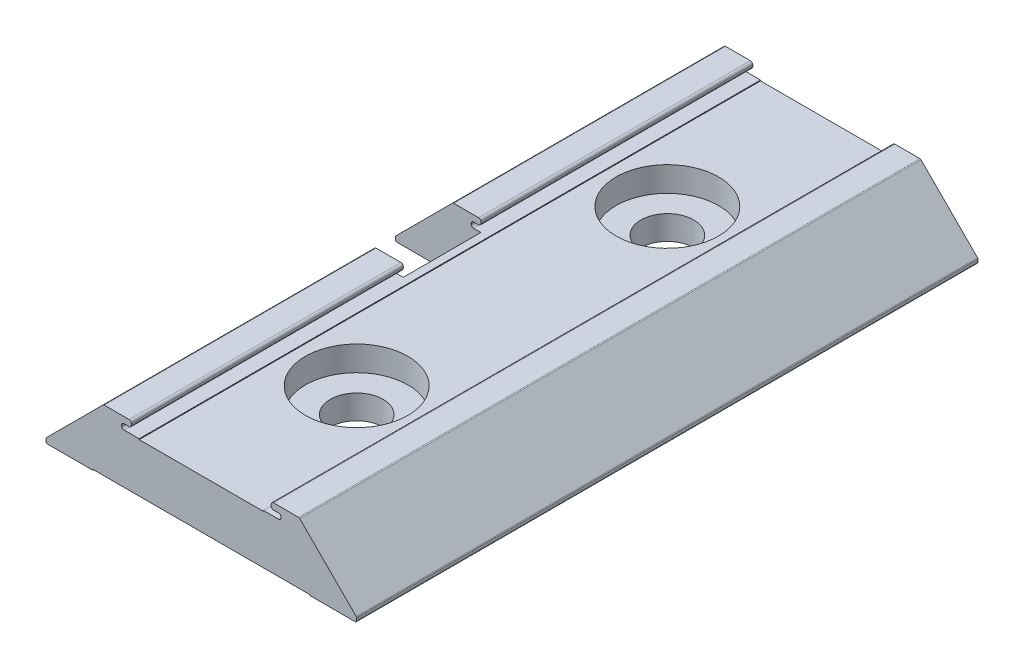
ISO-10303-21;
HEADER;
FILE_DESCRIPTION(('STEP AP214'),'2;1');
FILE_NAME('part.step','',(''),(''),'','','');
FILE_SCHEMA(('AUTOMOTIVE_DESIGN { 1 0 10303 214 1 1 1 1 }'));
ENDSEC;
DATA;
#1=APPLICATION_CONTEXT('core data for automotive mechanical design processes');
#2=APPLICATION_PROTOCOL_DEFINITION('international standard','automotive_design',2000,#1);
#3=PRODUCT_CONTEXT('',#1,'mechanical');
#4=PRODUCT('Part','Part','',(#3));
#5=PRODUCT_RELATED_PRODUCT_CATEGORY('part','',(#4));
#6=PRODUCT_DEFINITION_FORMATION('','',#4);
#7=PRODUCT_DEFINITION_CONTEXT('part definition',#1,'design');
#8=PRODUCT_DEFINITION('design','',#6,#7);
#9=PRODUCT_DEFINITION_SHAPE('','',#8);
#10=(LENGTH_UNIT() NAMED_UNIT(*) SI_UNIT(.MILLI.,.METRE.));
#11=(NAMED_UNIT(*) PLANE_ANGLE_UNIT() SI_UNIT($,.RADIAN.));
#12=(NAMED_UNIT(*) SI_UNIT($,.STERADIAN.) SOLID_ANGLE_UNIT());
#13=UNCERTAINTY_MEASURE_WITH_UNIT(LENGTH_MEASURE(1.E-05),#10,'distance_accuracy_value','');
#14=(GEOMETRIC_REPRESENTATION_CONTEXT(3) GLOBAL_UNCERTAINTY_ASSIGNED_CONTEXT((#13)) GLOBAL_UNIT_ASSIGNED_CONTEXT((#10,
#11,#12)) REPRESENTATION_CONTEXT('',''));
#15=CARTESIAN_POINT('',(0.,0.,0.));
#16=DIRECTION('',(0.,0.,1.));
#17=DIRECTION('',(1.,0.,0.));
#18=AXIS2_PLACEMENT_3D('',#15,#16,#17);
#19=CARTESIAN_POINT('',(3.,0.0499999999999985,40.));
#20=DIRECTION('',(-1.,0.,0.));
#21=DIRECTION('',(0.,-1.,0.));
#22=AXIS2_PLACEMENT_3D('',#19,#20,#21);
#23=PLANE('',#22);
#24=DIRECTION('',(0.,0.,-1.));
#25=VECTOR('',#24,1.);
#26=CARTESIAN_POINT('',(3.,0.0499999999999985,40.));
#27=LINE('',#26,#25);
#28=CARTESIAN_POINT('',(3.,0.0499999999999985,17.5));
#29=VERTEX_POINT('',#28);
#30=CARTESIAN_POINT('',(3.,0.0499999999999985,0.));
#31=VERTEX_POINT('',#30);
#32=EDGE_CURVE('E511',#29,#31,#27,.T.);
#33=ORIENTED_EDGE('',*,*,#32,.F.);
#34=DIRECTION('',(0.,-1.,0.));
#35=VECTOR('',#34,1.);
#36=CARTESIAN_POINT('',(3.,0.0499999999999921,17.5));
#37=LINE('',#36,#35);
#38=CARTESIAN_POINT('',(3.,0.,17.5));
#39=VERTEX_POINT('',#38);
#40=EDGE_CURVE('E960',#29,#39,#37,.T.);
#41=ORIENTED_EDGE('',*,*,#40,.T.);
#42=DIRECTION('',(0.,0.,-1.));
#43=VECTOR('',#42,1.);
#44=CARTESIAN_POINT('',(3.,0.,40.));
#45=LINE('',#44,#43);
#46=CARTESIAN_POINT('',(3.,0.,0.));
#47=VERTEX_POINT('',#46);
#48=EDGE_CURVE('E172',#39,#47,#45,.T.);
#49=ORIENTED_EDGE('',*,*,#48,.T.);
#50=DIRECTION('',(0.,1.,0.));
#51=VECTOR('',#50,1.);
#52=CARTESIAN_POINT('',(3.,0.0499999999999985,0.));
#53=LINE('',#52,#51);
#54=EDGE_CURVE('E311',#47,#31,#53,.T.);
#55=ORIENTED_EDGE('',*,*,#54,.T.);
#56=EDGE_LOOP('',(#33,#41,#49,#55));
#57=FACE_BOUND('',#56,.T.);
#58=ADVANCED_FACE('F30',(#57),#23,.F.);
#59=CARTESIAN_POINT('',(5.025,3.4,40.));
#60=DIRECTION('',(0.,0.,-1.));
#61=DIRECTION('',(-1.,0.,0.));
#62=AXIS2_PLACEMENT_3D('',#59,#60,#61);
#63=CYLINDRICAL_SURFACE('',#62,0.15);
#64=DIRECTION('',(0.,0.,-1.));
#65=VECTOR('',#64,1.);
#66=CARTESIAN_POINT('',(4.875,3.4,40.));
#67=LINE('',#66,#65);
#68=CARTESIAN_POINT('',(4.875,3.4,17.5));
#69=VERTEX_POINT('',#68);
#70=CARTESIAN_POINT('',(4.875,3.4,0.));
#71=VERTEX_POINT('',#70);
#72=EDGE_CURVE('E443',#69,#71,#67,.T.);
#73=ORIENTED_EDGE('',*,*,#72,.F.);
#74=CARTESIAN_POINT('',(5.025,3.4,17.5));
#75=DIRECTION('',(0.,0.,-1.));
#76=DIRECTION('',(0.,1.,0.));
#77=AXIS2_PLACEMENT_3D('',#74,#75,#76);
#78=CIRCLE('',#77,0.15);
#79=CARTESIAN_POINT('',(5.025,3.25,17.5));
#80=VERTEX_POINT('',#79);
#81=EDGE_CURVE('E699',#69,#80,#78,.F.);
#82=ORIENTED_EDGE('',*,*,#81,.T.);
#83=DIRECTION('',(0.,0.,-1.));
#84=VECTOR('',#83,1.);
#85=CARTESIAN_POINT('',(5.025,3.25,40.));
#86=LINE('',#85,#84);
#87=CARTESIAN_POINT('',(5.025,3.25,0.));
#88=VERTEX_POINT('',#87);
#89=EDGE_CURVE('E447',#80,#88,#86,.T.);
#90=ORIENTED_EDGE('',*,*,#89,.T.);
#91=CARTESIAN_POINT('',(5.025,3.4,0.));
#92=DIRECTION('',(0.,0.,-1.));
#93=DIRECTION('',(-1.,0.,0.));
#94=AXIS2_PLACEMENT_3D('',#91,#92,#93);
#95=CIRCLE('',#94,0.15);
#96=EDGE_CURVE('E358',#88,#71,#95,.T.);
#97=ORIENTED_EDGE('',*,*,#96,.T.);
#98=EDGE_LOOP('',(#73,#82,#90,#97));
#99=FACE_BOUND('',#98,.T.);
#100=ADVANCED_FACE('F714',(#99),#63,.F.);
#101=CARTESIAN_POINT('',(4.875,3.45,40.));
#102=DIRECTION('',(-1.,0.,0.));
#103=DIRECTION('',(0.,0.,1.));
#104=AXIS2_PLACEMENT_3D('',#101,#102,#103);
#105=PLANE('',#104);
#106=DIRECTION('',(0.,0.,-1.));
#107=VECTOR('',#106,1.);
#108=CARTESIAN_POINT('',(4.875,3.45,40.));
#109=LINE('',#108,#107);
#110=CARTESIAN_POINT('',(4.875,3.45,17.5));
#111=VERTEX_POINT('',#110);
#112=CARTESIAN_POINT('',(4.875,3.45,0.));
#113=VERTEX_POINT('',#112);
#114=EDGE_CURVE('E439',#111,#113,#109,.T.);
#115=ORIENTED_EDGE('',*,*,#114,.F.);
#116=DIRECTION('',(0.,-1.,0.));
#117=VECTOR('',#116,1.);
#118=CARTESIAN_POINT('',(4.875,3.44999999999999,17.5));
#119=LINE('',#118,#117);
#120=EDGE_CURVE('E715',#111,#69,#119,.T.);
#121=ORIENTED_EDGE('',*,*,#120,.T.);
#122=ORIENTED_EDGE('',*,*,#72,.T.);
#123=DIRECTION('',(0.,1.,0.));
#124=VECTOR('',#123,1.);
#125=CARTESIAN_POINT('',(4.875,3.45,0.));
#126=LINE('',#125,#124);
#127=EDGE_CURVE('E361',#71,#113,#126,.T.);
#128=ORIENTED_EDGE('',*,*,#127,.T.);
#129=EDGE_LOOP('',(#115,#121,#122,#128));
#130=FACE_BOUND('',#129,.T.);
#131=ADVANCED_FACE('F731',(#130),#105,.F.);
#132=CARTESIAN_POINT('',(5.025,3.45,40.));
#133=DIRECTION('',(0.,0.,-1.));
#134=DIRECTION('',(-1.,0.,0.));
#135=AXIS2_PLACEMENT_3D('',#132,#133,#134);
#136=CYLINDRICAL_SURFACE('',#135,0.15);
#137=DIRECTION('',(0.,0.,-1.));
#138=VECTOR('',#137,1.);
#139=CARTESIAN_POINT('',(5.025,3.6,40.));
#140=LINE('',#139,#138);
#141=CARTESIAN_POINT('',(5.025,3.6,17.5));
#142=VERTEX_POINT('',#141);
#143=CARTESIAN_POINT('',(5.025,3.6,0.));
#144=VERTEX_POINT('',#143);
#145=EDGE_CURVE('E435',#142,#144,#140,.T.);
#146=ORIENTED_EDGE('',*,*,#145,.F.);
#147=CARTESIAN_POINT('',(5.025,3.45,17.5));
#148=DIRECTION('',(0.,0.,-1.));
#149=DIRECTION('',(0.,1.,0.));
#150=AXIS2_PLACEMENT_3D('',#147,#148,#149);
#151=CIRCLE('',#150,0.15);
#152=EDGE_CURVE('E733',#142,#111,#151,.F.);
#153=ORIENTED_EDGE('',*,*,#152,.T.);
#154=ORIENTED_EDGE('',*,*,#114,.T.);
#155=CARTESIAN_POINT('',(5.025,3.45,0.));
#156=DIRECTION('',(0.,0.,-1.));
#157=DIRECTION('',(1.,0.,0.));
#158=AXIS2_PLACEMENT_3D('',#155,#156,#157);
#159=CIRCLE('',#158,0.15);
#160=EDGE_CURVE('E364',#113,#144,#159,.T.);
#161=ORIENTED_EDGE('',*,*,#160,.T.);
#162=EDGE_LOOP('',(#146,#153,#154,#161));
#163=FACE_BOUND('',#162,.T.);
#164=ADVANCED_FACE('F857',(#163),#136,.F.);
#165=CARTESIAN_POINT('',(5.35,3.6,40.));
#166=DIRECTION('',(0.,1.,0.));
#167=DIRECTION('',(0.,0.,1.));
#168=AXIS2_PLACEMENT_3D('',#165,#166,#167);
#169=PLANE('',#168);
#170=DIRECTION('',(0.,0.,-1.));
#171=VECTOR('',#170,1.);
#172=CARTESIAN_POINT('',(5.35,3.6,40.));
#173=LINE('',#172,#171);
#174=CARTESIAN_POINT('',(5.35,3.6,17.5));
#175=VERTEX_POINT('',#174);
#176=CARTESIAN_POINT('',(5.35,3.6,0.));
#177=VERTEX_POINT('',#176);
#178=EDGE_CURVE('E431',#175,#177,#173,.T.);
#179=ORIENTED_EDGE('',*,*,#178,.F.);
#180=DIRECTION('',(-1.,0.,0.));
#181=VECTOR('',#180,1.);
#182=CARTESIAN_POINT('',(5.35,3.6,17.5));
#183=LINE('',#182,#181);
#184=EDGE_CURVE('E735',#175,#142,#183,.T.);
#185=ORIENTED_EDGE('',*,*,#184,.T.);
#186=ORIENTED_EDGE('',*,*,#145,.T.);
#187=DIRECTION('',(1.,0.,0.));
#188=VECTOR('',#187,1.);
#189=CARTESIAN_POINT('',(5.35,3.6,0.));
#190=LINE('',#189,#188);
#191=EDGE_CURVE('E367',#144,#177,#190,.T.);
#192=ORIENTED_EDGE('',*,*,#191,.T.);
#193=EDGE_LOOP('',(#179,#185,#186,#192));
#194=FACE_BOUND('',#193,.T.);
#195=ADVANCED_FACE('F852',(#194),#169,.F.);
#196=CARTESIAN_POINT('',(5.35,3.75,40.));
#197=DIRECTION('',(0.,0.,-1.));
#198=DIRECTION('',(-1.,0.,0.));
#199=AXIS2_PLACEMENT_3D('',#196,#197,#198);
#200=CYLINDRICAL_SURFACE('',#199,0.15);
#201=DIRECTION('',(0.,0.,-1.));
#202=VECTOR('',#201,1.);
#203=CARTESIAN_POINT('',(5.5,3.75,40.));
#204=LINE('',#203,#202);
#205=CARTESIAN_POINT('',(5.5,3.75,17.5));
#206=VERTEX_POINT('',#205);
#207=CARTESIAN_POINT('',(5.5,3.75,0.));
#208=VERTEX_POINT('',#207);
#209=EDGE_CURVE('E427',#206,#208,#204,.T.);
#210=ORIENTED_EDGE('',*,*,#209,.F.);
#211=CARTESIAN_POINT('',(5.35,3.75,17.5));
#212=DIRECTION('',(0.,0.,-1.));
#213=DIRECTION('',(0.,1.,0.));
#214=AXIS2_PLACEMENT_3D('',#211,#212,#213);
#215=CIRCLE('',#214,0.15);
#216=EDGE_CURVE('E1009',#206,#175,#215,.T.);
#217=ORIENTED_EDGE('',*,*,#216,.T.);
#218=ORIENTED_EDGE('',*,*,#178,.T.);
#219=CARTESIAN_POINT('',(5.35,3.75,0.));
#220=DIRECTION('',(0.,0.,1.));
#221=DIRECTION('',(-1.,0.,0.));
#222=AXIS2_PLACEMENT_3D('',#219,#220,#221);
#223=CIRCLE('',#222,0.15);
#224=EDGE_CURVE('E370',#177,#208,#223,.T.);
#225=ORIENTED_EDGE('',*,*,#224,.T.);
#226=EDGE_LOOP('',(#210,#217,#218,#225));
#227=FACE_BOUND('',#226,.T.);
#228=ADVANCED_FACE('F847',(#227),#200,.T.);
#229=CARTESIAN_POINT('',(5.5,3.85,40.));
#230=DIRECTION('',(-1.,0.,0.));
#231=DIRECTION('',(0.,0.,1.));
#232=AXIS2_PLACEMENT_3D('',#229,#230,#231);
#233=PLANE('',#232);
#234=DIRECTION('',(0.,0.,-1.));
#235=VECTOR('',#234,1.);
#236=CARTESIAN_POINT('',(5.5,3.85,40.));
#237=LINE('',#236,#235);
#238=CARTESIAN_POINT('',(5.5,3.85,17.5));
#239=VERTEX_POINT('',#238);
#240=CARTESIAN_POINT('',(5.5,3.85,0.));
#241=VERTEX_POINT('',#240);
#242=EDGE_CURVE('E423',#239,#241,#237,.T.);
#243=ORIENTED_EDGE('',*,*,#242,.F.);
#244=DIRECTION('',(0.,-1.,0.));
#245=VECTOR('',#244,1.);
#246=CARTESIAN_POINT('',(5.5,7.83299042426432,17.5));
#247=LINE('',#246,#245);
#248=EDGE_CURVE('E1001',#239,#206,#247,.T.);
#249=ORIENTED_EDGE('',*,*,#248,.T.);
#250=ORIENTED_EDGE('',*,*,#209,.T.);
#251=DIRECTION('',(0.,1.,0.));
#252=VECTOR('',#251,1.);
#253=CARTESIAN_POINT('',(5.5,3.85,0.));
#254=LINE('',#253,#252);
#255=EDGE_CURVE('E373',#208,#241,#254,.T.);
#256=ORIENTED_EDGE('',*,*,#255,.T.);
#257=EDGE_LOOP('',(#243,#249,#250,#256));
#258=FACE_BOUND('',#257,.T.);
#259=ADVANCED_FACE('F842',(#258),#233,.F.);
#260=CARTESIAN_POINT('',(5.35,3.85,40.));
#261=DIRECTION('',(0.,0.,-1.));
#262=DIRECTION('',(-1.,0.,0.));
#263=AXIS2_PLACEMENT_3D('',#260,#261,#262);
#264=CYLINDRICAL_SURFACE('',#263,0.15);
#265=DIRECTION('',(0.,0.,-1.));
#266=VECTOR('',#265,1.);
#267=CARTESIAN_POINT('',(5.35,4.,40.));
#268=LINE('',#267,#266);
#269=CARTESIAN_POINT('',(5.35,4.,17.5));
#270=VERTEX_POINT('',#269);
#271=CARTESIAN_POINT('',(5.35,4.,0.));
#272=VERTEX_POINT('',#271);
#273=EDGE_CURVE('E419',#270,#272,#268,.T.);
#274=ORIENTED_EDGE('',*,*,#273,.F.);
#275=CARTESIAN_POINT('',(5.35,3.85,17.5));
#276=DIRECTION('',(0.,0.,-1.));
#277=DIRECTION('',(0.,1.,0.));
#278=AXIS2_PLACEMENT_3D('',#275,#276,#277);
#279=CIRCLE('',#278,0.15);
#280=EDGE_CURVE('E997',#270,#239,#279,.T.);
#281=ORIENTED_EDGE('',*,*,#280,.T.);
#282=ORIENTED_EDGE('',*,*,#242,.T.);
#283=CARTESIAN_POINT('',(5.35,3.85,0.));
#284=DIRECTION('',(0.,0.,1.));
#285=DIRECTION('',(-1.,0.,0.));
#286=AXIS2_PLACEMENT_3D('',#283,#284,#285);
#287=CIRCLE('',#286,0.15);
#288=EDGE_CURVE('E376',#241,#272,#287,.T.);
#289=ORIENTED_EDGE('',*,*,#288,.T.);
#290=EDGE_LOOP('',(#274,#281,#282,#289));
#291=FACE_BOUND('',#290,.T.);
#292=ADVANCED_FACE('F837',(#291),#264,.T.);
#293=CARTESIAN_POINT('',(3.74142135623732,4.,40.));
#294=DIRECTION('',(0.,-1.,0.));
#295=DIRECTION('',(0.,0.,-1.));
#296=AXIS2_PLACEMENT_3D('',#293,#294,#295);
#297=PLANE('',#296);
#298=DIRECTION('',(0.,0.,-1.));
#299=VECTOR('',#298,1.);
#300=CARTESIAN_POINT('',(3.74142135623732,4.,40.));
#301=LINE('',#300,#299);
#302=CARTESIAN_POINT('',(3.74142135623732,4.,17.5));
#303=VERTEX_POINT('',#302);
#304=CARTESIAN_POINT('',(3.74142135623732,4.,0.));
#305=VERTEX_POINT('',#304);
#306=EDGE_CURVE('E415',#303,#305,#301,.T.);
#307=ORIENTED_EDGE('',*,*,#306,.F.);
#308=DIRECTION('',(1.,0.,0.));
#309=VECTOR('',#308,1.);
#310=CARTESIAN_POINT('',(3.74142135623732,4.,17.5));
#311=LINE('',#310,#309);
#312=EDGE_CURVE('E1011',#303,#270,#311,.T.);
#313=ORIENTED_EDGE('',*,*,#312,.T.);
#314=ORIENTED_EDGE('',*,*,#273,.T.);
#315=DIRECTION('',(-1.,0.,0.));
#316=VECTOR('',#315,1.);
#317=CARTESIAN_POINT('',(3.74142135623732,4.,0.));
#318=LINE('',#317,#316);
#319=EDGE_CURVE('E379',#272,#305,#318,.T.);
#320=ORIENTED_EDGE('',*,*,#319,.T.);
#321=EDGE_LOOP('',(#307,#313,#314,#320));
#322=FACE_BOUND('',#321,.T.);
#323=ADVANCED_FACE('F832',(#322),#297,.F.);
#324=CARTESIAN_POINT('',(3.74142135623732,3.9,40.));
#325=DIRECTION('',(0.,0.,-1.));
#326=DIRECTION('',(-1.,0.,0.));
#327=AXIS2_PLACEMENT_3D('',#324,#325,#326);
#328=CYLINDRICAL_SURFACE('',#327,0.0999999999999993);
#329=DIRECTION('',(0.,0.,-1.));
#330=VECTOR('',#329,1.);
#331=CARTESIAN_POINT('',(3.67071067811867,3.97071067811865,40.));
#332=LINE('',#331,#330);
#333=CARTESIAN_POINT('',(3.67071067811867,3.97071067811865,17.5));
#334=VERTEX_POINT('',#333);
#335=CARTESIAN_POINT('',(3.67071067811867,3.97071067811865,0.));
#336=VERTEX_POINT('',#335);
#337=EDGE_CURVE('E411',#334,#336,#332,.T.);
#338=ORIENTED_EDGE('',*,*,#337,.F.);
#339=CARTESIAN_POINT('',(3.74142135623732,3.9,17.5));
#340=DIRECTION('',(0.,0.,-1.));
#341=DIRECTION('',(0.,1.,0.));
#342=AXIS2_PLACEMENT_3D('',#339,#340,#341);
#343=CIRCLE('',#342,0.0999999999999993);
#344=EDGE_CURVE('E987',#334,#303,#343,.T.);
#345=ORIENTED_EDGE('',*,*,#344,.T.);
#346=ORIENTED_EDGE('',*,*,#306,.T.);
#347=CARTESIAN_POINT('',(3.74142135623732,3.9,0.));
#348=DIRECTION('',(0.,0.,1.));
#349=DIRECTION('',(-1.,0.,0.));
#350=AXIS2_PLACEMENT_3D('',#347,#348,#349);
#351=CIRCLE('',#350,0.0999999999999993);
#352=EDGE_CURVE('E382',#305,#336,#351,.T.);
#353=ORIENTED_EDGE('',*,*,#352,.T.);
#354=EDGE_LOOP('',(#338,#345,#346,#353));
#355=FACE_BOUND('',#354,.T.);
#356=ADVANCED_FACE('F827',(#355),#328,.T.);
#357=CARTESIAN_POINT('',(0.0292893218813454,0.329289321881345,40.));
#358=DIRECTION('',(0.707106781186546,-0.707106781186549,0.));
#359=DIRECTION('',(0.707106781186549,0.707106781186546,0.));
#360=AXIS2_PLACEMENT_3D('',#357,#358,#359);
#361=PLANE('',#360);
#362=DIRECTION('',(0.,0.,-1.));
#363=VECTOR('',#362,1.);
#364=CARTESIAN_POINT('',(0.0292893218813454,0.329289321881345,40.));
#365=LINE('',#364,#363);
#366=CARTESIAN_POINT('',(0.0292893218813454,0.329289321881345,17.5));
#367=VERTEX_POINT('',#366);
#368=CARTESIAN_POINT('',(0.0292893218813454,0.329289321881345,0.));
#369=VERTEX_POINT('',#368);
#370=EDGE_CURVE('E407',#367,#369,#365,.T.);
#371=ORIENTED_EDGE('',*,*,#370,.F.);
#372=DIRECTION('',(0.707106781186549,0.707106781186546,0.));
#373=VECTOR('',#372,1.);
#374=CARTESIAN_POINT('',(0.0292893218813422,0.329289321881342,17.5));
#375=LINE('',#374,#373);
#376=EDGE_CURVE('E983',#367,#334,#375,.T.);
#377=ORIENTED_EDGE('',*,*,#376,.T.);
#378=ORIENTED_EDGE('',*,*,#337,.T.);
#379=DIRECTION('',(-0.707106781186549,-0.707106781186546,0.));
#380=VECTOR('',#379,1.);
#381=CARTESIAN_POINT('',(0.0292893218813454,0.329289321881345,0.));
#382=LINE('',#381,#380);
#383=EDGE_CURVE('E385',#336,#369,#382,.T.);
#384=ORIENTED_EDGE('',*,*,#383,.T.);
#385=EDGE_LOOP('',(#371,#377,#378,#384));
#386=FACE_BOUND('',#385,.T.);
#387=ADVANCED_FACE('F822',(#386),#361,.F.);
#388=CARTESIAN_POINT('',(0.1,0.25857864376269,40.));
#389=DIRECTION('',(0.,0.,-1.));
#390=DIRECTION('',(-1.,0.,0.));
#391=AXIS2_PLACEMENT_3D('',#388,#389,#390);
#392=CYLINDRICAL_SURFACE('',#391,0.1);
#393=DIRECTION('',(0.,0.,-1.));
#394=VECTOR('',#393,1.);
#395=CARTESIAN_POINT('',(0.,0.25857864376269,40.));
#396=LINE('',#395,#394);
#397=CARTESIAN_POINT('',(0.,0.25857864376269,17.5));
#398=VERTEX_POINT('',#397);
#399=CARTESIAN_POINT('',(0.,0.25857864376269,0.));
#400=VERTEX_POINT('',#399);
#401=EDGE_CURVE('E301',#398,#400,#396,.T.);
#402=ORIENTED_EDGE('',*,*,#401,.F.);
#403=CARTESIAN_POINT('',(0.1,0.25857864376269,17.5));
#404=DIRECTION('',(0.,0.,-1.));
#405=DIRECTION('',(0.,1.,0.));
#406=AXIS2_PLACEMENT_3D('',#403,#404,#405);
#407=CIRCLE('',#406,0.1);
#408=EDGE_CURVE('E1017',#398,#367,#407,.T.);
#409=ORIENTED_EDGE('',*,*,#408,.T.);
#410=ORIENTED_EDGE('',*,*,#370,.T.);
#411=CARTESIAN_POINT('',(0.1,0.25857864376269,0.));
#412=DIRECTION('',(0.,0.,1.));
#413=DIRECTION('',(1.,0.,0.));
#414=AXIS2_PLACEMENT_3D('',#411,#412,#413);
#415=CIRCLE('',#414,0.1);
#416=EDGE_CURVE('E388',#369,#400,#415,.T.);
#417=ORIENTED_EDGE('',*,*,#416,.T.);
#418=EDGE_LOOP('',(#402,#409,#410,#417));
#419=FACE_BOUND('',#418,.T.);
#420=ADVANCED_FACE('F818',(#419),#392,.T.);
#421=CARTESIAN_POINT('',(0.,0.1,40.));
#422=DIRECTION('',(1.,0.,0.));
#423=DIRECTION('',(0.,0.,-1.));
#424=AXIS2_PLACEMENT_3D('',#421,#422,#423);
#425=PLANE('',#424);
#426=DIRECTION('',(0.,0.,-1.));
#427=VECTOR('',#426,1.);
#428=CARTESIAN_POINT('',(0.,0.1,40.));
#429=LINE('',#428,#427);
#430=CARTESIAN_POINT('',(0.,0.1,17.5));
#431=VERTEX_POINT('',#430);
#432=CARTESIAN_POINT('',(0.,0.1,0.));
#433=VERTEX_POINT('',#432);
#434=EDGE_CURVE('E302',#431,#433,#429,.T.);
#435=ORIENTED_EDGE('',*,*,#434,.F.);
#436=DIRECTION('',(0.,-1.,0.));
#437=VECTOR('',#436,1.);
#438=CARTESIAN_POINT('',(0.,7.83299042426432,17.5));
#439=LINE('',#438,#437);
#440=EDGE_CURVE('E973',#398,#431,#439,.T.);
#441=ORIENTED_EDGE('',*,*,#440,.F.);
#442=ORIENTED_EDGE('',*,*,#401,.T.);
#443=DIRECTION('',(0.,-1.,0.));
#444=VECTOR('',#443,1.);
#445=CARTESIAN_POINT('',(0.,0.1,0.));
#446=LINE('',#445,#444);
#447=EDGE_CURVE('E391',#400,#433,#446,.T.);
#448=ORIENTED_EDGE('',*,*,#447,.T.);
#449=EDGE_LOOP('',(#435,#441,#442,#448));
#450=FACE_BOUND('',#449,.T.);
#451=ADVANCED_FACE('F801',(#450),#425,.F.);
#452=CARTESIAN_POINT('',(0.1,0.1,40.));
#453=DIRECTION('',(0.,0.,-1.));
#454=DIRECTION('',(-1.,0.,0.));
#455=AXIS2_PLACEMENT_3D('',#452,#453,#454);
#456=CYLINDRICAL_SURFACE('',#455,0.1);
#457=DIRECTION('',(0.,0.,-1.));
#458=VECTOR('',#457,1.);
#459=CARTESIAN_POINT('',(0.1,0.,40.));
#460=LINE('',#459,#458);
#461=CARTESIAN_POINT('',(0.1,0.,17.5));
#462=VERTEX_POINT('',#461);
#463=CARTESIAN_POINT('',(0.1,0.,0.));
#464=VERTEX_POINT('',#463);
#465=EDGE_CURVE('E403',#462,#464,#460,.T.);
#466=ORIENTED_EDGE('',*,*,#465,.F.);
#467=CARTESIAN_POINT('',(0.1,0.1,17.5));
#468=DIRECTION('',(0.,0.,-1.));
#469=DIRECTION('',(0.,1.,0.));
#470=AXIS2_PLACEMENT_3D('',#467,#468,#469);
#471=CIRCLE('',#470,0.1);
#472=EDGE_CURVE('E962',#462,#431,#471,.T.);
#473=ORIENTED_EDGE('',*,*,#472,.T.);
#474=ORIENTED_EDGE('',*,*,#434,.T.);
#475=CARTESIAN_POINT('',(0.1,0.1,0.));
#476=DIRECTION('',(0.,0.,1.));
#477=DIRECTION('',(-1.,0.,0.));
#478=AXIS2_PLACEMENT_3D('',#475,#476,#477);
#479=CIRCLE('',#478,0.1);
#480=EDGE_CURVE('E394',#433,#464,#479,.T.);
#481=ORIENTED_EDGE('',*,*,#480,.T.);
#482=EDGE_LOOP('',(#466,#473,#474,#481));
#483=FACE_BOUND('',#482,.T.);
#484=ADVANCED_FACE('F795',(#483),#456,.T.);
#485=CARTESIAN_POINT('',(0.1,0.,40.));
#486=DIRECTION('',(0.,1.,0.));
#487=DIRECTION('',(0.,0.,1.));
#488=AXIS2_PLACEMENT_3D('',#485,#486,#487);
#489=PLANE('',#488);
#490=ORIENTED_EDGE('',*,*,#48,.F.);
#491=DIRECTION('',(-1.,0.,0.));
#492=VECTOR('',#491,1.);
#493=CARTESIAN_POINT('',(0.1,0.,17.5));
#494=LINE('',#493,#492);
#495=EDGE_CURVE('E11',#39,#462,#494,.T.);
#496=ORIENTED_EDGE('',*,*,#495,.T.);
#497=ORIENTED_EDGE('',*,*,#465,.T.);
#498=DIRECTION('',(1.,0.,0.));
#499=VECTOR('',#498,1.);
#500=CARTESIAN_POINT('',(0.1,0.,0.));
#501=LINE('',#500,#499);
#502=EDGE_CURVE('E397',#464,#47,#501,.T.);
#503=ORIENTED_EDGE('',*,*,#502,.T.);
#504=EDGE_LOOP('',(#490,#496,#497,#503));
#505=FACE_BOUND('',#504,.T.);
#506=ADVANCED_FACE('F788',(#505),#489,.F.);
#507=CARTESIAN_POINT('',(3.,0.,40.));
#508=VERTEX_POINT('',#507);
#509=CARTESIAN_POINT('',(3.,0.,22.5));
#510=VERTEX_POINT('',#509);
#511=EDGE_CURVE('E400',#508,#510,#45,.T.);
#512=ORIENTED_EDGE('',*,*,#511,.T.);
#513=DIRECTION('',(0.,1.,0.));
#514=VECTOR('',#513,1.);
#515=CARTESIAN_POINT('',(3.,0.0500000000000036,22.5));
#516=LINE('',#515,#514);
#517=CARTESIAN_POINT('',(3.,0.0499999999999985,22.5));
#518=VERTEX_POINT('',#517);
#519=EDGE_CURVE('E45',#510,#518,#516,.T.);
#520=ORIENTED_EDGE('',*,*,#519,.T.);
#521=CARTESIAN_POINT('',(3.,0.0499999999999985,40.));
#522=VERTEX_POINT('',#521);
#523=EDGE_CURVE('E512',#522,#518,#27,.T.);
#524=ORIENTED_EDGE('',*,*,#523,.F.);
#525=DIRECTION('',(0.,1.,0.));
#526=VECTOR('',#525,1.);
#527=CARTESIAN_POINT('',(3.,0.0499999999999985,40.));
#528=LINE('',#527,#526);
#529=EDGE_CURVE('E399',#508,#522,#528,.T.);
#530=ORIENTED_EDGE('',*,*,#529,.F.);
#531=EDGE_LOOP('',(#512,#520,#524,#530));
#532=FACE_BOUND('',#531,.T.);
#533=ADVANCED_FACE('F32',(#532),#23,.F.);
#534=CARTESIAN_POINT('',(17.,0.0500000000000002,40.));
#535=DIRECTION('',(0.,1.,0.));
#536=DIRECTION('',(-1.,0.,0.));
#537=AXIS2_PLACEMENT_3D('',#534,#535,#536);
#538=PLANE('',#537);
#539=CARTESIAN_POINT('',(10.,0.0499999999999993,30.));
#540=DIRECTION('',(0.,1.,0.));
#541=DIRECTION('',(-1.,0.,0.));
#542=AXIS2_PLACEMENT_3D('',#539,#540,#541);
#543=CIRCLE('',#542,1.7);
#544=CARTESIAN_POINT('',(8.3,0.0499999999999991,30.));
#545=VERTEX_POINT('',#544);
#546=EDGE_CURVE('E745',#545,#545,#543,.T.);
#547=ORIENTED_EDGE('',*,*,#546,.T.);
#548=EDGE_LOOP('',(#547));
#549=FACE_BOUND('',#548,.T.);
#550=CARTESIAN_POINT('',(10.,0.0499999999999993,10.));
#551=DIRECTION('',(0.,1.,0.));
#552=DIRECTION('',(-1.,0.,0.));
#553=AXIS2_PLACEMENT_3D('',#550,#551,#552);
#554=CIRCLE('',#553,1.7);
#555=CARTESIAN_POINT('',(8.3,0.0499999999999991,10.));
#556=VERTEX_POINT('',#555);
#557=EDGE_CURVE('E314',#556,#556,#554,.T.);
#558=ORIENTED_EDGE('',*,*,#557,.T.);
#559=EDGE_LOOP('',(#558));
#560=FACE_BOUND('',#559,.T.);
#561=DIRECTION('',(0.,0.,1.));
#562=VECTOR('',#561,1.);
#563=CARTESIAN_POINT('',(5.5,0.0499999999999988,40.));
#564=LINE('',#563,#562);
#565=CARTESIAN_POINT('',(5.5,0.0499999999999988,17.5));
#566=VERTEX_POINT('',#565);
#567=CARTESIAN_POINT('',(5.5,0.0499999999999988,22.5));
#568=VERTEX_POINT('',#567);
#569=EDGE_CURVE('E740',#566,#568,#564,.T.);
#570=ORIENTED_EDGE('',*,*,#569,.F.);
#571=DIRECTION('',(-1.,0.,0.));
#572=VECTOR('',#571,1.);
#573=CARTESIAN_POINT('',(17.,0.0500000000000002,17.5));
#574=LINE('',#573,#572);
#575=EDGE_CURVE('E961',#566,#29,#574,.T.);
#576=ORIENTED_EDGE('',*,*,#575,.T.);
#577=ORIENTED_EDGE('',*,*,#32,.T.);
#578=DIRECTION('',(1.,0.,0.));
#579=VECTOR('',#578,1.);
#580=CARTESIAN_POINT('',(17.,0.0500000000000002,0.));
#581=LINE('',#580,#579);
#582=CARTESIAN_POINT('',(17.,0.0500000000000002,0.));
#583=VERTEX_POINT('',#582);
#584=EDGE_CURVE('E313',#31,#583,#581,.T.);
#585=ORIENTED_EDGE('',*,*,#584,.T.);
#586=DIRECTION('',(0.,0.,-1.));
#587=VECTOR('',#586,1.);
#588=CARTESIAN_POINT('',(17.,0.0500000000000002,40.));
#589=LINE('',#588,#587);
#590=CARTESIAN_POINT('',(17.,0.0500000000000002,40.));
#591=VERTEX_POINT('',#590);
#592=EDGE_CURVE('E508',#591,#583,#589,.T.);
#593=ORIENTED_EDGE('',*,*,#592,.F.);
#594=DIRECTION('',(1.,0.,0.));
#595=VECTOR('',#594,1.);
#596=CARTESIAN_POINT('',(17.,0.0500000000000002,40.));
#597=LINE('',#596,#595);
#598=EDGE_CURVE('E181',#522,#591,#597,.T.);
#599=ORIENTED_EDGE('',*,*,#598,.F.);
#600=ORIENTED_EDGE('',*,*,#523,.T.);
#601=DIRECTION('',(1.,0.,0.));
#602=VECTOR('',#601,1.);
#603=CARTESIAN_POINT('',(17.,0.0500000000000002,22.5));
#604=LINE('',#603,#602);
#605=EDGE_CURVE('E1050',#518,#568,#604,.T.);
#606=ORIENTED_EDGE('',*,*,#605,.T.);
#607=EDGE_LOOP('',(#570,#576,#577,#585,#593,#599,#600,#606));
#608=FACE_BOUND('',#607,.T.);
#609=ADVANCED_FACE('F787',(#549,#560,#608),#538,.F.);
#610=CARTESIAN_POINT('',(17.,0.,40.));
#611=DIRECTION('',(1.,0.,0.));
#612=DIRECTION('',(0.,0.,-1.));
#613=AXIS2_PLACEMENT_3D('',#610,#611,#612);
#614=PLANE('',#613);
#615=DIRECTION('',(0.,-1.,0.));
#616=VECTOR('',#615,1.);
#617=CARTESIAN_POINT('',(17.,0.,0.));
#618=LINE('',#617,#616);
#619=CARTESIAN_POINT('',(17.,0.,0.));
#620=VERTEX_POINT('',#619);
#621=EDGE_CURVE('E316',#583,#620,#618,.T.);
#622=ORIENTED_EDGE('',*,*,#621,.T.);
#623=DIRECTION('',(0.,0.,-1.));
#624=VECTOR('',#623,1.);
#625=CARTESIAN_POINT('',(17.,0.,40.));
#626=LINE('',#625,#624);
#627=CARTESIAN_POINT('',(17.,0.,40.));
#628=VERTEX_POINT('',#627);
#629=EDGE_CURVE('E505',#628,#620,#626,.T.);
#630=ORIENTED_EDGE('',*,*,#629,.F.);
#631=DIRECTION('',(0.,-1.,0.));
#632=VECTOR('',#631,1.);
#633=CARTESIAN_POINT('',(17.,0.,40.));
#634=LINE('',#633,#632);
#635=EDGE_CURVE('E525',#591,#628,#634,.T.);
#636=ORIENTED_EDGE('',*,*,#635,.F.);
#637=ORIENTED_EDGE('',*,*,#592,.T.);
#638=EDGE_LOOP('',(#622,#630,#636,#637));
#639=FACE_BOUND('',#638,.T.);
#640=ADVANCED_FACE('F793',(#639),#614,.F.);
#641=CARTESIAN_POINT('',(19.9,0.,40.));
#642=DIRECTION('',(0.,1.,0.));
#643=DIRECTION('',(-1.,0.,0.));
#644=AXIS2_PLACEMENT_3D('',#641,#642,#643);
#645=PLANE('',#644);
#646=DIRECTION('',(1.,0.,0.));
#647=VECTOR('',#646,1.);
#648=CARTESIAN_POINT('',(19.9,0.,0.));
#649=LINE('',#648,#647);
#650=CARTESIAN_POINT('',(19.9,0.,0.));
#651=VERTEX_POINT('',#650);
#652=EDGE_CURVE('E318',#620,#651,#649,.T.);
#653=ORIENTED_EDGE('',*,*,#652,.T.);
#654=DIRECTION('',(0.,0.,-1.));
#655=VECTOR('',#654,1.);
#656=CARTESIAN_POINT('',(19.9,0.,40.));
#657=LINE('',#656,#655);
#658=CARTESIAN_POINT('',(19.9,0.,40.));
#659=VERTEX_POINT('',#658);
#660=EDGE_CURVE('E502',#659,#651,#657,.T.);
#661=ORIENTED_EDGE('',*,*,#660,.F.);
#662=DIRECTION('',(1.,0.,0.));
#663=VECTOR('',#662,1.);
#664=CARTESIAN_POINT('',(19.9,0.,40.));
#665=LINE('',#664,#663);
#666=EDGE_CURVE('E531',#628,#659,#665,.T.);
#667=ORIENTED_EDGE('',*,*,#666,.F.);
#668=ORIENTED_EDGE('',*,*,#629,.T.);
#669=EDGE_LOOP('',(#653,#661,#667,#668));
#670=FACE_BOUND('',#669,.T.);
#671=ADVANCED_FACE('F932',(#670),#645,.F.);
#672=CARTESIAN_POINT('',(19.9,0.1,40.));
#673=DIRECTION('',(0.,0.,-1.));
#674=DIRECTION('',(-1.,0.,0.));
#675=AXIS2_PLACEMENT_3D('',#672,#673,#674);
#676=CYLINDRICAL_SURFACE('',#675,0.0999999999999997);
#677=CARTESIAN_POINT('',(19.9,0.1,0.));
#678=DIRECTION('',(0.,0.,1.));
#679=DIRECTION('',(-1.,0.,0.));
#680=AXIS2_PLACEMENT_3D('',#677,#678,#679);
#681=CIRCLE('',#680,0.0999999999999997);
#682=CARTESIAN_POINT('',(20.,0.1,0.));
#683=VERTEX_POINT('',#682);
#684=EDGE_CURVE('E320',#651,#683,#681,.T.);
#685=ORIENTED_EDGE('',*,*,#684,.T.);
#686=DIRECTION('',(0.,0.,-1.));
#687=VECTOR('',#686,1.);
#688=CARTESIAN_POINT('',(20.,0.1,40.));
#689=LINE('',#688,#687);
#690=CARTESIAN_POINT('',(20.,0.1,40.));
#691=VERTEX_POINT('',#690);
#692=EDGE_CURVE('E499',#691,#683,#689,.T.);
#693=ORIENTED_EDGE('',*,*,#692,.F.);
#694=CARTESIAN_POINT('',(19.9,0.1,40.));
#695=DIRECTION('',(0.,0.,1.));
#696=DIRECTION('',(-1.,0.,0.));
#697=AXIS2_PLACEMENT_3D('',#694,#695,#696);
#698=CIRCLE('',#697,0.0999999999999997);
#699=EDGE_CURVE('E533',#659,#691,#698,.T.);
#700=ORIENTED_EDGE('',*,*,#699,.F.);
#701=ORIENTED_EDGE('',*,*,#660,.T.);
#702=EDGE_LOOP('',(#685,#693,#700,#701));
#703=FACE_BOUND('',#702,.T.);
#704=ADVANCED_FACE('F928',(#703),#676,.T.);
#705=CARTESIAN_POINT('',(20.,0.25857864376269,40.));
#706=DIRECTION('',(-1.,0.,0.));
#707=DIRECTION('',(0.,0.,1.));
#708=AXIS2_PLACEMENT_3D('',#705,#706,#707);
#709=PLANE('',#708);
#710=DIRECTION('',(0.,1.,0.));
#711=VECTOR('',#710,1.);
#712=CARTESIAN_POINT('',(20.,0.25857864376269,0.));
#713=LINE('',#712,#711);
#714=CARTESIAN_POINT('',(20.,0.25857864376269,0.));
#715=VERTEX_POINT('',#714);
#716=EDGE_CURVE('E322',#683,#715,#713,.T.);
#717=ORIENTED_EDGE('',*,*,#716,.T.);
#718=DIRECTION('',(0.,0.,-1.));
#719=VECTOR('',#718,1.);
#720=CARTESIAN_POINT('',(20.,0.25857864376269,40.));
#721=LINE('',#720,#719);
#722=CARTESIAN_POINT('',(20.,0.25857864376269,40.));
#723=VERTEX_POINT('',#722);
#724=EDGE_CURVE('E496',#723,#715,#721,.T.);
#725=ORIENTED_EDGE('',*,*,#724,.F.);
#726=DIRECTION('',(0.,1.,0.));
#727=VECTOR('',#726,1.);
#728=CARTESIAN_POINT('',(20.,0.25857864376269,40.));
#729=LINE('',#728,#727);
#730=EDGE_CURVE('E535',#691,#723,#729,.T.);
#731=ORIENTED_EDGE('',*,*,#730,.F.);
#732=ORIENTED_EDGE('',*,*,#692,.T.);
#733=EDGE_LOOP('',(#717,#725,#731,#732));
#734=FACE_BOUND('',#733,.T.);
#735=ADVANCED_FACE('F924',(#734),#709,.F.);
#736=CARTESIAN_POINT('',(19.9,0.258578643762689,40.));
#737=DIRECTION('',(0.,0.,-1.));
#738=DIRECTION('',(-1.,0.,0.));
#739=AXIS2_PLACEMENT_3D('',#736,#737,#738);
#740=CYLINDRICAL_SURFACE('',#739,0.0999999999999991);
#741=CARTESIAN_POINT('',(19.9,0.258578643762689,0.));
#742=DIRECTION('',(0.,0.,1.));
#743=DIRECTION('',(-1.,0.,0.));
#744=AXIS2_PLACEMENT_3D('',#741,#742,#743);
#745=CIRCLE('',#744,0.0999999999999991);
#746=CARTESIAN_POINT('',(19.9707106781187,0.329289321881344,0.));
#747=VERTEX_POINT('',#746);
#748=EDGE_CURVE('E324',#715,#747,#745,.T.);
#749=ORIENTED_EDGE('',*,*,#748,.T.);
#750=DIRECTION('',(0.,0.,-1.));
#751=VECTOR('',#750,1.);
#752=CARTESIAN_POINT('',(19.9707106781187,0.329289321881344,40.));
#753=LINE('',#752,#751);
#754=CARTESIAN_POINT('',(19.9707106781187,0.329289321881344,40.));
#755=VERTEX_POINT('',#754);
#756=EDGE_CURVE('E493',#755,#747,#753,.T.);
#757=ORIENTED_EDGE('',*,*,#756,.F.);
#758=CARTESIAN_POINT('',(19.9,0.258578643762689,40.));
#759=DIRECTION('',(0.,0.,1.));
#760=DIRECTION('',(-1.,0.,0.));
#761=AXIS2_PLACEMENT_3D('',#758,#759,#760);
#762=CIRCLE('',#761,0.0999999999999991);
#763=EDGE_CURVE('E537',#723,#755,#762,.T.);
#764=ORIENTED_EDGE('',*,*,#763,.F.);
#765=ORIENTED_EDGE('',*,*,#724,.T.);
#766=EDGE_LOOP('',(#749,#757,#764,#765));
#767=FACE_BOUND('',#766,.T.);
#768=ADVANCED_FACE('F920',(#767),#740,.T.);
#769=CARTESIAN_POINT('',(16.3292893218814,3.97071067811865,40.));
#770=DIRECTION('',(-0.707106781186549,-0.707106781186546,0.));
#771=DIRECTION('',(0.707106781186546,-0.707106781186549,0.));
#772=AXIS2_PLACEMENT_3D('',#769,#770,#771);
#773=PLANE('',#772);
#774=DIRECTION('',(-0.707106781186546,0.707106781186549,0.));
#775=VECTOR('',#774,1.);
#776=CARTESIAN_POINT('',(16.3292893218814,3.97071067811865,0.));
#777=LINE('',#776,#775);
#778=CARTESIAN_POINT('',(16.3292893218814,3.97071067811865,0.));
#779=VERTEX_POINT('',#778);
#780=EDGE_CURVE('E326',#747,#779,#777,.T.);
#781=ORIENTED_EDGE('',*,*,#780,.T.);
#782=DIRECTION('',(0.,0.,-1.));
#783=VECTOR('',#782,1.);
#784=CARTESIAN_POINT('',(16.3292893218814,3.97071067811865,40.));
#785=LINE('',#784,#783);
#786=CARTESIAN_POINT('',(16.3292893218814,3.97071067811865,40.));
#787=VERTEX_POINT('',#786);
#788=EDGE_CURVE('E490',#787,#779,#785,.T.);
#789=ORIENTED_EDGE('',*,*,#788,.F.);
#790=DIRECTION('',(-0.707106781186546,0.707106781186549,0.));
#791=VECTOR('',#790,1.);
#792=CARTESIAN_POINT('',(16.3292893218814,3.97071067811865,40.));
#793=LINE('',#792,#791);
#794=EDGE_CURVE('E539',#755,#787,#793,.T.);
#795=ORIENTED_EDGE('',*,*,#794,.F.);
#796=ORIENTED_EDGE('',*,*,#756,.T.);
#797=EDGE_LOOP('',(#781,#789,#795,#796));
#798=FACE_BOUND('',#797,.T.);
#799=ADVANCED_FACE('F916',(#798),#773,.F.);
#800=CARTESIAN_POINT('',(16.2585786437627,3.9,40.));
#801=DIRECTION('',(0.,0.,-1.));
#802=DIRECTION('',(-1.,0.,0.));
#803=AXIS2_PLACEMENT_3D('',#800,#801,#802);
#804=CYLINDRICAL_SURFACE('',#803,0.100000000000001);
#805=CARTESIAN_POINT('',(16.2585786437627,3.9,0.));
#806=DIRECTION('',(0.,0.,1.));
#807=DIRECTION('',(1.,0.,0.));
#808=AXIS2_PLACEMENT_3D('',#805,#806,#807);
#809=CIRCLE('',#808,0.100000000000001);
#810=CARTESIAN_POINT('',(16.2585786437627,4.,0.));
#811=VERTEX_POINT('',#810);
#812=EDGE_CURVE('E328',#779,#811,#809,.T.);
#813=ORIENTED_EDGE('',*,*,#812,.T.);
#814=DIRECTION('',(0.,0.,-1.));
#815=VECTOR('',#814,1.);
#816=CARTESIAN_POINT('',(16.2585786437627,4.,40.));
#817=LINE('',#816,#815);
#818=CARTESIAN_POINT('',(16.2585786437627,4.,40.));
#819=VERTEX_POINT('',#818);
#820=EDGE_CURVE('E487',#819,#811,#817,.T.);
#821=ORIENTED_EDGE('',*,*,#820,.F.);
#822=CARTESIAN_POINT('',(16.2585786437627,3.9,40.));
#823=DIRECTION('',(0.,0.,1.));
#824=DIRECTION('',(1.,0.,0.));
#825=AXIS2_PLACEMENT_3D('',#822,#823,#824);
#826=CIRCLE('',#825,0.100000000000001);
#827=EDGE_CURVE('E541',#787,#819,#826,.T.);
#828=ORIENTED_EDGE('',*,*,#827,.F.);
#829=ORIENTED_EDGE('',*,*,#788,.T.);
#830=EDGE_LOOP('',(#813,#821,#828,#829));
#831=FACE_BOUND('',#830,.T.);
#832=ADVANCED_FACE('F912',(#831),#804,.T.);
#833=CARTESIAN_POINT('',(14.65,4.,40.));
#834=DIRECTION('',(0.,-1.,0.));
#835=DIRECTION('',(1.,0.,0.));
#836=AXIS2_PLACEMENT_3D('',#833,#834,#835);
#837=PLANE('',#836);
#838=DIRECTION('',(-1.,0.,0.));
#839=VECTOR('',#838,1.);
#840=CARTESIAN_POINT('',(14.65,4.,0.));
#841=LINE('',#840,#839);
#842=CARTESIAN_POINT('',(14.65,4.,0.));
#843=VERTEX_POINT('',#842);
#844=EDGE_CURVE('E330',#811,#843,#841,.T.);
#845=ORIENTED_EDGE('',*,*,#844,.T.);
#846=DIRECTION('',(0.,0.,-1.));
#847=VECTOR('',#846,1.);
#848=CARTESIAN_POINT('',(14.65,4.,40.));
#849=LINE('',#848,#847);
#850=CARTESIAN_POINT('',(14.65,4.,40.));
#851=VERTEX_POINT('',#850);
#852=EDGE_CURVE('E484',#851,#843,#849,.T.);
#853=ORIENTED_EDGE('',*,*,#852,.F.);
#854=DIRECTION('',(-1.,0.,0.));
#855=VECTOR('',#854,1.);
#856=CARTESIAN_POINT('',(14.65,4.,40.));
#857=LINE('',#856,#855);
#858=EDGE_CURVE('E543',#819,#851,#857,.T.);
#859=ORIENTED_EDGE('',*,*,#858,.F.);
#860=ORIENTED_EDGE('',*,*,#820,.T.);
#861=EDGE_LOOP('',(#845,#853,#859,#860));
#862=FACE_BOUND('',#861,.T.);
#863=ADVANCED_FACE('F908',(#862),#837,.F.);
#864=CARTESIAN_POINT('',(14.65,3.85,40.));
#865=DIRECTION('',(0.,0.,-1.));
#866=DIRECTION('',(-1.,0.,0.));
#867=AXIS2_PLACEMENT_3D('',#864,#865,#866);
#868=CYLINDRICAL_SURFACE('',#867,0.150000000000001);
#869=CARTESIAN_POINT('',(14.65,3.85,0.));
#870=DIRECTION('',(0.,0.,1.));
#871=DIRECTION('',(1.,0.,0.));
#872=AXIS2_PLACEMENT_3D('',#869,#870,#871);
#873=CIRCLE('',#872,0.150000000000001);
#874=CARTESIAN_POINT('',(14.5,3.85,0.));
#875=VERTEX_POINT('',#874);
#876=EDGE_CURVE('E332',#843,#875,#873,.T.);
#877=ORIENTED_EDGE('',*,*,#876,.T.);
#878=DIRECTION('',(0.,0.,-1.));
#879=VECTOR('',#878,1.);
#880=CARTESIAN_POINT('',(14.5,3.85,40.));
#881=LINE('',#880,#879);
#882=CARTESIAN_POINT('',(14.5,3.85,40.));
#883=VERTEX_POINT('',#882);
#884=EDGE_CURVE('E481',#883,#875,#881,.T.);
#885=ORIENTED_EDGE('',*,*,#884,.F.);
#886=CARTESIAN_POINT('',(14.65,3.85,40.));
#887=DIRECTION('',(0.,0.,1.));
#888=DIRECTION('',(1.,0.,0.));
#889=AXIS2_PLACEMENT_3D('',#886,#887,#888);
#890=CIRCLE('',#889,0.150000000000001);
#891=EDGE_CURVE('E545',#851,#883,#890,.T.);
#892=ORIENTED_EDGE('',*,*,#891,.F.);
#893=ORIENTED_EDGE('',*,*,#852,.T.);
#894=EDGE_LOOP('',(#877,#885,#892,#893));
#895=FACE_BOUND('',#894,.T.);
#896=ADVANCED_FACE('F904',(#895),#868,.T.);
#897=CARTESIAN_POINT('',(14.5,3.75,40.));
#898=DIRECTION('',(1.,0.,0.));
#899=DIRECTION('',(0.,0.,-1.));
#900=AXIS2_PLACEMENT_3D('',#897,#898,#899);
#901=PLANE('',#900);
#902=DIRECTION('',(0.,-1.,0.));
#903=VECTOR('',#902,1.);
#904=CARTESIAN_POINT('',(14.5,3.75,0.));
#905=LINE('',#904,#903);
#906=CARTESIAN_POINT('',(14.5,3.75,0.));
#907=VERTEX_POINT('',#906);
#908=EDGE_CURVE('E334',#875,#907,#905,.T.);
#909=ORIENTED_EDGE('',*,*,#908,.T.);
#910=DIRECTION('',(0.,0.,-1.));
#911=VECTOR('',#910,1.);
#912=CARTESIAN_POINT('',(14.5,3.75,40.));
#913=LINE('',#912,#911);
#914=CARTESIAN_POINT('',(14.5,3.75,40.));
#915=VERTEX_POINT('',#914);
#916=EDGE_CURVE('E478',#915,#907,#913,.T.);
#917=ORIENTED_EDGE('',*,*,#916,.F.);
#918=DIRECTION('',(0.,-1.,0.));
#919=VECTOR('',#918,1.);
#920=CARTESIAN_POINT('',(14.5,3.75,40.));
#921=LINE('',#920,#919);
#922=EDGE_CURVE('E547',#883,#915,#921,.T.);
#923=ORIENTED_EDGE('',*,*,#922,.F.);
#924=ORIENTED_EDGE('',*,*,#884,.T.);
#925=EDGE_LOOP('',(#909,#917,#923,#924));
#926=FACE_BOUND('',#925,.T.);
#927=ADVANCED_FACE('F900',(#926),#901,.F.);
#928=CARTESIAN_POINT('',(14.65,3.75,40.));
#929=DIRECTION('',(0.,0.,-1.));
#930=DIRECTION('',(-1.,0.,0.));
#931=AXIS2_PLACEMENT_3D('',#928,#929,#930);
#932=CYLINDRICAL_SURFACE('',#931,0.15);
#933=CARTESIAN_POINT('',(14.65,3.75,0.));
#934=DIRECTION('',(0.,0.,1.));
#935=DIRECTION('',(1.,0.,0.));
#936=AXIS2_PLACEMENT_3D('',#933,#934,#935);
#937=CIRCLE('',#936,0.15);
#938=CARTESIAN_POINT('',(14.65,3.6,0.));
#939=VERTEX_POINT('',#938);
#940=EDGE_CURVE('E336',#907,#939,#937,.T.);
#941=ORIENTED_EDGE('',*,*,#940,.T.);
#942=DIRECTION('',(0.,0.,-1.));
#943=VECTOR('',#942,1.);
#944=CARTESIAN_POINT('',(14.65,3.6,40.));
#945=LINE('',#944,#943);
#946=CARTESIAN_POINT('',(14.65,3.6,40.));
#947=VERTEX_POINT('',#946);
#948=EDGE_CURVE('E475',#947,#939,#945,.T.);
#949=ORIENTED_EDGE('',*,*,#948,.F.);
#950=CARTESIAN_POINT('',(14.65,3.75,40.));
#951=DIRECTION('',(0.,0.,1.));
#952=DIRECTION('',(1.,0.,0.));
#953=AXIS2_PLACEMENT_3D('',#950,#951,#952);
#954=CIRCLE('',#953,0.15);
#955=EDGE_CURVE('E549',#915,#947,#954,.T.);
#956=ORIENTED_EDGE('',*,*,#955,.F.);
#957=ORIENTED_EDGE('',*,*,#916,.T.);
#958=EDGE_LOOP('',(#941,#949,#956,#957));
#959=FACE_BOUND('',#958,.T.);
#960=ADVANCED_FACE('F896',(#959),#932,.T.);
#961=CARTESIAN_POINT('',(14.975,3.6,40.));
#962=DIRECTION('',(0.,1.,0.));
#963=DIRECTION('',(0.,0.,1.));
#964=AXIS2_PLACEMENT_3D('',#961,#962,#963);
#965=PLANE('',#964);
#966=DIRECTION('',(1.,0.,0.));
#967=VECTOR('',#966,1.);
#968=CARTESIAN_POINT('',(14.975,3.6,0.));
#969=LINE('',#968,#967);
#970=CARTESIAN_POINT('',(14.975,3.6,0.));
#971=VERTEX_POINT('',#970);
#972=EDGE_CURVE('E338',#939,#971,#969,.T.);
#973=ORIENTED_EDGE('',*,*,#972,.T.);
#974=DIRECTION('',(0.,0.,-1.));
#975=VECTOR('',#974,1.);
#976=CARTESIAN_POINT('',(14.975,3.6,40.));
#977=LINE('',#976,#975);
#978=CARTESIAN_POINT('',(14.975,3.6,40.));
#979=VERTEX_POINT('',#978);
#980=EDGE_CURVE('E472',#979,#971,#977,.T.);
#981=ORIENTED_EDGE('',*,*,#980,.F.);
#982=DIRECTION('',(1.,0.,0.));
#983=VECTOR('',#982,1.);
#984=CARTESIAN_POINT('',(14.975,3.6,40.));
#985=LINE('',#984,#983);
#986=EDGE_CURVE('E551',#947,#979,#985,.T.);
#987=ORIENTED_EDGE('',*,*,#986,.F.);
#988=ORIENTED_EDGE('',*,*,#948,.T.);
#989=EDGE_LOOP('',(#973,#981,#987,#988));
#990=FACE_BOUND('',#989,.T.);
#991=ADVANCED_FACE('F892',(#990),#965,.F.);
#992=CARTESIAN_POINT('',(14.975,3.45,40.));
#993=DIRECTION('',(0.,0.,-1.));
#994=DIRECTION('',(-1.,0.,0.));
#995=AXIS2_PLACEMENT_3D('',#992,#993,#994);
#996=CYLINDRICAL_SURFACE('',#995,0.15);
#997=CARTESIAN_POINT('',(14.975,3.45,0.));
#998=DIRECTION('',(0.,0.,-1.));
#999=DIRECTION('',(-1.,0.,0.));
#1000=AXIS2_PLACEMENT_3D('',#997,#998,#999);
#1001=CIRCLE('',#1000,0.15);
#1002=CARTESIAN_POINT('',(15.125,3.45,0.));
#1003=VERTEX_POINT('',#1002);
#1004=EDGE_CURVE('E340',#971,#1003,#1001,.T.);
#1005=ORIENTED_EDGE('',*,*,#1004,.T.);
#1006=DIRECTION('',(0.,0.,-1.));
#1007=VECTOR('',#1006,1.);
#1008=CARTESIAN_POINT('',(15.125,3.45,40.));
#1009=LINE('',#1008,#1007);
#1010=CARTESIAN_POINT('',(15.125,3.45,40.));
#1011=VERTEX_POINT('',#1010);
#1012=EDGE_CURVE('E469',#1011,#1003,#1009,.T.);
#1013=ORIENTED_EDGE('',*,*,#1012,.F.);
#1014=CARTESIAN_POINT('',(14.975,3.45,40.));
#1015=DIRECTION('',(0.,0.,-1.));
#1016=DIRECTION('',(-1.,0.,0.));
#1017=AXIS2_PLACEMENT_3D('',#1014,#1015,#1016);
#1018=CIRCLE('',#1017,0.15);
#1019=EDGE_CURVE('E553',#979,#1011,#1018,.T.);
#1020=ORIENTED_EDGE('',*,*,#1019,.F.);
#1021=ORIENTED_EDGE('',*,*,#980,.T.);
#1022=EDGE_LOOP('',(#1005,#1013,#1020,#1021));
#1023=FACE_BOUND('',#1022,.T.);
#1024=ADVANCED_FACE('F888',(#1023),#996,.F.);
#1025=CARTESIAN_POINT('',(15.125,3.4,40.));
#1026=DIRECTION('',(1.,0.,0.));
#1027=DIRECTION('',(0.,0.,-1.));
#1028=AXIS2_PLACEMENT_3D('',#1025,#1026,#1027);
#1029=PLANE('',#1028);
#1030=DIRECTION('',(0.,-1.,0.));
#1031=VECTOR('',#1030,1.);
#1032=CARTESIAN_POINT('',(15.125,3.4,0.));
#1033=LINE('',#1032,#1031);
#1034=CARTESIAN_POINT('',(15.125,3.4,0.));
#1035=VERTEX_POINT('',#1034);
#1036=EDGE_CURVE('E342',#1003,#1035,#1033,.T.);
#1037=ORIENTED_EDGE('',*,*,#1036,.T.);
#1038=DIRECTION('',(0.,0.,-1.));
#1039=VECTOR('',#1038,1.);
#1040=CARTESIAN_POINT('',(15.125,3.4,40.));
#1041=LINE('',#1040,#1039);
#1042=CARTESIAN_POINT('',(15.125,3.4,40.));
#1043=VERTEX_POINT('',#1042);
#1044=EDGE_CURVE('E466',#1043,#1035,#1041,.T.);
#1045=ORIENTED_EDGE('',*,*,#1044,.F.);
#1046=DIRECTION('',(0.,-1.,0.));
#1047=VECTOR('',#1046,1.);
#1048=CARTESIAN_POINT('',(15.125,3.4,40.));
#1049=LINE('',#1048,#1047);
#1050=EDGE_CURVE('E555',#1011,#1043,#1049,.T.);
#1051=ORIENTED_EDGE('',*,*,#1050,.F.);
#1052=ORIENTED_EDGE('',*,*,#1012,.T.);
#1053=EDGE_LOOP('',(#1037,#1045,#1051,#1052));
#1054=FACE_BOUND('',#1053,.T.);
#1055=ADVANCED_FACE('F884',(#1054),#1029,.F.);
#1056=CARTESIAN_POINT('',(14.975,3.4,40.));
#1057=DIRECTION('',(0.,0.,-1.));
#1058=DIRECTION('',(-1.,0.,0.));
#1059=AXIS2_PLACEMENT_3D('',#1056,#1057,#1058);
#1060=CYLINDRICAL_SURFACE('',#1059,0.15);
#1061=CARTESIAN_POINT('',(14.975,3.4,0.));
#1062=DIRECTION('',(0.,0.,-1.));
#1063=DIRECTION('',(-1.,0.,0.));
#1064=AXIS2_PLACEMENT_3D('',#1061,#1062,#1063);
#1065=CIRCLE('',#1064,0.15);
#1066=CARTESIAN_POINT('',(14.975,3.25,0.));
#1067=VERTEX_POINT('',#1066);
#1068=EDGE_CURVE('E344',#1035,#1067,#1065,.T.);
#1069=ORIENTED_EDGE('',*,*,#1068,.T.);
#1070=DIRECTION('',(0.,0.,-1.));
#1071=VECTOR('',#1070,1.);
#1072=CARTESIAN_POINT('',(14.975,3.25,40.));
#1073=LINE('',#1072,#1071);
#1074=CARTESIAN_POINT('',(14.975,3.25,40.));
#1075=VERTEX_POINT('',#1074);
#1076=EDGE_CURVE('E463',#1075,#1067,#1073,.T.);
#1077=ORIENTED_EDGE('',*,*,#1076,.F.);
#1078=CARTESIAN_POINT('',(14.975,3.4,40.));
#1079=DIRECTION('',(0.,0.,-1.));
#1080=DIRECTION('',(-1.,0.,0.));
#1081=AXIS2_PLACEMENT_3D('',#1078,#1079,#1080);
#1082=CIRCLE('',#1081,0.15);
#1083=EDGE_CURVE('E557',#1043,#1075,#1082,.T.);
#1084=ORIENTED_EDGE('',*,*,#1083,.F.);
#1085=ORIENTED_EDGE('',*,*,#1044,.T.);
#1086=EDGE_LOOP('',(#1069,#1077,#1084,#1085));
#1087=FACE_BOUND('',#1086,.T.);
#1088=ADVANCED_FACE('F880',(#1087),#1060,.F.);
#1089=CARTESIAN_POINT('',(14.,3.25,40.));
#1090=DIRECTION('',(0.,-1.,0.));
#1091=DIRECTION('',(0.,0.,-1.));
#1092=AXIS2_PLACEMENT_3D('',#1089,#1090,#1091);
#1093=PLANE('',#1092);
#1094=DIRECTION('',(-1.,0.,0.));
#1095=VECTOR('',#1094,1.);
#1096=CARTESIAN_POINT('',(14.,3.25,0.));
#1097=LINE('',#1096,#1095);
#1098=CARTESIAN_POINT('',(14.,3.25,0.));
#1099=VERTEX_POINT('',#1098);
#1100=EDGE_CURVE('E346',#1067,#1099,#1097,.T.);
#1101=ORIENTED_EDGE('',*,*,#1100,.T.);
#1102=DIRECTION('',(0.,0.,-1.));
#1103=VECTOR('',#1102,1.);
#1104=CARTESIAN_POINT('',(14.,3.25,40.));
#1105=LINE('',#1104,#1103);
#1106=CARTESIAN_POINT('',(14.,3.25,40.));
#1107=VERTEX_POINT('',#1106);
#1108=EDGE_CURVE('E460',#1107,#1099,#1105,.T.);
#1109=ORIENTED_EDGE('',*,*,#1108,.F.);
#1110=DIRECTION('',(-1.,0.,0.));
#1111=VECTOR('',#1110,1.);
#1112=CARTESIAN_POINT('',(14.,3.25,40.));
#1113=LINE('',#1112,#1111);
#1114=EDGE_CURVE('E559',#1075,#1107,#1113,.T.);
#1115=ORIENTED_EDGE('',*,*,#1114,.F.);
#1116=ORIENTED_EDGE('',*,*,#1076,.T.);
#1117=EDGE_LOOP('',(#1101,#1109,#1115,#1116));
#1118=FACE_BOUND('',#1117,.T.);
#1119=ADVANCED_FACE('F876',(#1118),#1093,.F.);
#1120=CARTESIAN_POINT('',(14.,3.25,40.));
#1121=DIRECTION('',(1.,0.,0.));
#1122=DIRECTION('',(0.,0.,-1.));
#1123=AXIS2_PLACEMENT_3D('',#1120,#1121,#1122);
#1124=PLANE('',#1123);
#1125=DIRECTION('',(0.,-1.,0.));
#1126=VECTOR('',#1125,1.);
#1127=CARTESIAN_POINT('',(14.,3.25,0.));
#1128=LINE('',#1127,#1126);
#1129=CARTESIAN_POINT('',(14.,3.2,0.));
#1130=VERTEX_POINT('',#1129);
#1131=EDGE_CURVE('E348',#1099,#1130,#1128,.T.);
#1132=ORIENTED_EDGE('',*,*,#1131,.T.);
#1133=DIRECTION('',(0.,0.,-1.));
#1134=VECTOR('',#1133,1.);
#1135=CARTESIAN_POINT('',(14.,3.2,40.));
#1136=LINE('',#1135,#1134);
#1137=CARTESIAN_POINT('',(14.,3.2,40.));
#1138=VERTEX_POINT('',#1137);
#1139=EDGE_CURVE('E457',#1138,#1130,#1136,.T.);
#1140=ORIENTED_EDGE('',*,*,#1139,.F.);
#1141=DIRECTION('',(0.,-1.,0.));
#1142=VECTOR('',#1141,1.);
#1143=CARTESIAN_POINT('',(14.,3.25,40.));
#1144=LINE('',#1143,#1142);
#1145=EDGE_CURVE('E561',#1107,#1138,#1144,.T.);
#1146=ORIENTED_EDGE('',*,*,#1145,.F.);
#1147=ORIENTED_EDGE('',*,*,#1108,.T.);
#1148=EDGE_LOOP('',(#1132,#1140,#1146,#1147));
#1149=FACE_BOUND('',#1148,.T.);
#1150=ADVANCED_FACE('F872',(#1149),#1124,.F.);
#1151=CARTESIAN_POINT('',(6.,3.2,40.));
#1152=DIRECTION('',(0.,-1.,0.));
#1153=DIRECTION('',(0.,0.,-1.));
#1154=AXIS2_PLACEMENT_3D('',#1151,#1152,#1153);
#1155=PLANE('',#1154);
#1156=CARTESIAN_POINT('',(10.,3.2,30.));
#1157=DIRECTION('',(0.,1.,0.));
#1158=DIRECTION('',(0.,0.,1.));
#1159=AXIS2_PLACEMENT_3D('',#1156,#1157,#1158);
#1160=CIRCLE('',#1159,3.3);
#1161=CARTESIAN_POINT('',(10.,3.2,33.3));
#1162=VERTEX_POINT('',#1161);
#1163=EDGE_CURVE('E742',#1162,#1162,#1160,.T.);
#1164=ORIENTED_EDGE('',*,*,#1163,.F.);
#1165=EDGE_LOOP('',(#1164));
#1166=FACE_BOUND('',#1165,.T.);
#1167=CARTESIAN_POINT('',(10.,3.2,10.));
#1168=DIRECTION('',(0.,1.,0.));
#1169=DIRECTION('',(0.,0.,1.));
#1170=AXIS2_PLACEMENT_3D('',#1167,#1168,#1169);
#1171=CIRCLE('',#1170,3.3);
#1172=CARTESIAN_POINT('',(10.,3.2,13.3));
#1173=VERTEX_POINT('',#1172);
#1174=EDGE_CURVE('E754',#1173,#1173,#1171,.T.);
#1175=ORIENTED_EDGE('',*,*,#1174,.F.);
#1176=EDGE_LOOP('',(#1175));
#1177=FACE_BOUND('',#1176,.T.);
#1178=DIRECTION('',(-1.,0.,0.));
#1179=VECTOR('',#1178,1.);
#1180=CARTESIAN_POINT('',(6.,3.2,0.));
#1181=LINE('',#1180,#1179);
#1182=CARTESIAN_POINT('',(6.,3.2,0.));
#1183=VERTEX_POINT('',#1182);
#1184=EDGE_CURVE('E351',#1130,#1183,#1181,.T.);
#1185=ORIENTED_EDGE('',*,*,#1184,.T.);
#1186=DIRECTION('',(0.,0.,-1.));
#1187=VECTOR('',#1186,1.);
#1188=CARTESIAN_POINT('',(6.,3.2,40.));
#1189=LINE('',#1188,#1187);
#1190=CARTESIAN_POINT('',(6.,3.2,40.));
#1191=VERTEX_POINT('',#1190);
#1192=EDGE_CURVE('E454',#1191,#1183,#1189,.T.);
#1193=ORIENTED_EDGE('',*,*,#1192,.F.);
#1194=DIRECTION('',(-1.,0.,0.));
#1195=VECTOR('',#1194,1.);
#1196=CARTESIAN_POINT('',(9.9,3.2,40.));
#1197=LINE('',#1196,#1195);
#1198=EDGE_CURVE('E563',#1138,#1191,#1197,.T.);
#1199=ORIENTED_EDGE('',*,*,#1198,.F.);
#1200=ORIENTED_EDGE('',*,*,#1139,.T.);
#1201=EDGE_LOOP('',(#1185,#1193,#1199,#1200));
#1202=FACE_BOUND('',#1201,.T.);
#1203=ADVANCED_FACE('F868',(#1166,#1177,#1202),#1155,.F.);
#1204=CARTESIAN_POINT('',(6.,3.25,40.));
#1205=DIRECTION('',(-1.,0.,0.));
#1206=DIRECTION('',(0.,0.,1.));
#1207=AXIS2_PLACEMENT_3D('',#1204,#1205,#1206);
#1208=PLANE('',#1207);
#1209=DIRECTION('',(0.,1.,0.));
#1210=VECTOR('',#1209,1.);
#1211=CARTESIAN_POINT('',(6.,3.25,0.));
#1212=LINE('',#1211,#1210);
#1213=CARTESIAN_POINT('',(6.,3.25,0.));
#1214=VERTEX_POINT('',#1213);
#1215=EDGE_CURVE('E353',#1183,#1214,#1212,.T.);
#1216=ORIENTED_EDGE('',*,*,#1215,.T.);
#1217=DIRECTION('',(0.,0.,-1.));
#1218=VECTOR('',#1217,1.);
#1219=CARTESIAN_POINT('',(6.,3.25,40.));
#1220=LINE('',#1219,#1218);
#1221=CARTESIAN_POINT('',(6.,3.25,40.));
#1222=VERTEX_POINT('',#1221);
#1223=EDGE_CURVE('E451',#1222,#1214,#1220,.T.);
#1224=ORIENTED_EDGE('',*,*,#1223,.F.);
#1225=DIRECTION('',(0.,1.,0.));
#1226=VECTOR('',#1225,1.);
#1227=CARTESIAN_POINT('',(6.,3.25,40.));
#1228=LINE('',#1227,#1226);
#1229=EDGE_CURVE('E565',#1191,#1222,#1228,.T.);
#1230=ORIENTED_EDGE('',*,*,#1229,.F.);
#1231=ORIENTED_EDGE('',*,*,#1192,.T.);
#1232=EDGE_LOOP('',(#1216,#1224,#1230,#1231));
#1233=FACE_BOUND('',#1232,.T.);
#1234=ADVANCED_FACE('F865',(#1233),#1208,.F.);
#1235=CARTESIAN_POINT('',(5.025,3.25,40.));
#1236=DIRECTION('',(0.,-1.,0.));
#1237=DIRECTION('',(0.,0.,-1.));
#1238=AXIS2_PLACEMENT_3D('',#1235,#1236,#1237);
#1239=PLANE('',#1238);
#1240=ORIENTED_EDGE('',*,*,#89,.F.);
#1241=DIRECTION('',(1.,0.,0.));
#1242=VECTOR('',#1241,1.);
#1243=CARTESIAN_POINT('',(5.025,3.25,17.5));
#1244=LINE('',#1243,#1242);
#1245=CARTESIAN_POINT('',(5.5,3.25,17.5));
#1246=VERTEX_POINT('',#1245);
#1247=EDGE_CURVE('E703',#80,#1246,#1244,.T.);
#1248=ORIENTED_EDGE('',*,*,#1247,.T.);
#1249=DIRECTION('',(0.,0.,-1.));
#1250=VECTOR('',#1249,1.);
#1251=CARTESIAN_POINT('',(5.5,3.25,40.));
#1252=LINE('',#1251,#1250);
#1253=CARTESIAN_POINT('',(5.5,3.25,22.5));
#1254=VERTEX_POINT('',#1253);
#1255=EDGE_CURVE('E710',#1254,#1246,#1252,.T.);
#1256=ORIENTED_EDGE('',*,*,#1255,.F.);
#1257=DIRECTION('',(-1.,0.,0.));
#1258=VECTOR('',#1257,1.);
#1259=CARTESIAN_POINT('',(5.025,3.25,22.5));
#1260=LINE('',#1259,#1258);
#1261=CARTESIAN_POINT('',(5.025,3.25,22.5));
#1262=VERTEX_POINT('',#1261);
#1263=EDGE_CURVE('E1021',#1254,#1262,#1260,.T.);
#1264=ORIENTED_EDGE('',*,*,#1263,.T.);
#1265=CARTESIAN_POINT('',(5.025,3.25,40.));
#1266=VERTEX_POINT('',#1265);
#1267=EDGE_CURVE('E448',#1266,#1262,#86,.T.);
#1268=ORIENTED_EDGE('',*,*,#1267,.F.);
#1269=DIRECTION('',(-1.,0.,0.));
#1270=VECTOR('',#1269,1.);
#1271=CARTESIAN_POINT('',(5.025,3.25,40.));
#1272=LINE('',#1271,#1270);
#1273=EDGE_CURVE('E567',#1222,#1266,#1272,.T.);
#1274=ORIENTED_EDGE('',*,*,#1273,.F.);
#1275=ORIENTED_EDGE('',*,*,#1223,.T.);
#1276=DIRECTION('',(-1.,0.,0.));
#1277=VECTOR('',#1276,1.);
#1278=CARTESIAN_POINT('',(5.025,3.25,0.));
#1279=LINE('',#1278,#1277);
#1280=EDGE_CURVE('E355',#1214,#88,#1279,.T.);
#1281=ORIENTED_EDGE('',*,*,#1280,.T.);
#1282=EDGE_LOOP('',(#1240,#1248,#1256,#1264,#1268,#1274,#1275,#1281));
#1283=FACE_BOUND('',#1282,.T.);
#1284=ADVANCED_FACE('F717',(#1283),#1239,.F.);
#1285=ORIENTED_EDGE('',*,*,#1267,.T.);
#1286=CARTESIAN_POINT('',(5.025,3.4,22.5));
#1287=DIRECTION('',(0.,0.,1.));
#1288=DIRECTION('',(0.,-1.,0.));
#1289=AXIS2_PLACEMENT_3D('',#1286,#1287,#1288);
#1290=CIRCLE('',#1289,0.15);
#1291=CARTESIAN_POINT('',(4.875,3.4,22.5));
#1292=VERTEX_POINT('',#1291);
#1293=EDGE_CURVE('E1024',#1262,#1292,#1290,.F.);
#1294=ORIENTED_EDGE('',*,*,#1293,.T.);
#1295=CARTESIAN_POINT('',(4.875,3.4,40.));
#1296=VERTEX_POINT('',#1295);
#1297=EDGE_CURVE('E444',#1296,#1292,#67,.T.);
#1298=ORIENTED_EDGE('',*,*,#1297,.F.);
#1299=CARTESIAN_POINT('',(5.025,3.4,40.));
#1300=DIRECTION('',(0.,0.,-1.));
#1301=DIRECTION('',(-1.,0.,0.));
#1302=AXIS2_PLACEMENT_3D('',#1299,#1300,#1301);
#1303=CIRCLE('',#1302,0.15);
#1304=EDGE_CURVE('E569',#1266,#1296,#1303,.T.);
#1305=ORIENTED_EDGE('',*,*,#1304,.F.);
#1306=EDGE_LOOP('',(#1285,#1294,#1298,#1305));
#1307=FACE_BOUND('',#1306,.T.);
#1308=ADVANCED_FACE('F784',(#1307),#63,.F.);
#1309=ORIENTED_EDGE('',*,*,#1297,.T.);
#1310=DIRECTION('',(0.,1.,0.));
#1311=VECTOR('',#1310,1.);
#1312=CARTESIAN_POINT('',(4.875,3.45,22.5));
#1313=LINE('',#1312,#1311);
#1314=CARTESIAN_POINT('',(4.875,3.45,22.5));
#1315=VERTEX_POINT('',#1314);
#1316=EDGE_CURVE('E1027',#1292,#1315,#1313,.T.);
#1317=ORIENTED_EDGE('',*,*,#1316,.T.);
#1318=CARTESIAN_POINT('',(4.875,3.45,40.));
#1319=VERTEX_POINT('',#1318);
#1320=EDGE_CURVE('E440',#1319,#1315,#109,.T.);
#1321=ORIENTED_EDGE('',*,*,#1320,.F.);
#1322=DIRECTION('',(0.,1.,0.));
#1323=VECTOR('',#1322,1.);
#1324=CARTESIAN_POINT('',(4.875,3.45,40.));
#1325=LINE('',#1324,#1323);
#1326=EDGE_CURVE('E571',#1296,#1319,#1325,.T.);
#1327=ORIENTED_EDGE('',*,*,#1326,.F.);
#1328=EDGE_LOOP('',(#1309,#1317,#1321,#1327));
#1329=FACE_BOUND('',#1328,.T.);
#1330=ADVANCED_FACE('F855',(#1329),#105,.F.);
#1331=ORIENTED_EDGE('',*,*,#1320,.T.);
#1332=CARTESIAN_POINT('',(5.025,3.45,22.5));
#1333=DIRECTION('',(0.,0.,1.));
#1334=DIRECTION('',(0.,-1.,0.));
#1335=AXIS2_PLACEMENT_3D('',#1332,#1333,#1334);
#1336=CIRCLE('',#1335,0.15);
#1337=CARTESIAN_POINT('',(5.025,3.6,22.5));
#1338=VERTEX_POINT('',#1337);
#1339=EDGE_CURVE('E1030',#1315,#1338,#1336,.F.);
#1340=ORIENTED_EDGE('',*,*,#1339,.T.);
#1341=CARTESIAN_POINT('',(5.025,3.6,40.));
#1342=VERTEX_POINT('',#1341);
#1343=EDGE_CURVE('E436',#1342,#1338,#140,.T.);
#1344=ORIENTED_EDGE('',*,*,#1343,.F.);
#1345=CARTESIAN_POINT('',(5.025,3.45,40.));
#1346=DIRECTION('',(0.,0.,-1.));
#1347=DIRECTION('',(1.,0.,0.));
#1348=AXIS2_PLACEMENT_3D('',#1345,#1346,#1347);
#1349=CIRCLE('',#1348,0.15);
#1350=EDGE_CURVE('E573',#1319,#1342,#1349,.T.);
#1351=ORIENTED_EDGE('',*,*,#1350,.F.);
#1352=EDGE_LOOP('',(#1331,#1340,#1344,#1351));
#1353=FACE_BOUND('',#1352,.T.);
#1354=ADVANCED_FACE('F850',(#1353),#136,.F.);
#1355=ORIENTED_EDGE('',*,*,#1343,.T.);
#1356=DIRECTION('',(1.,0.,0.));
#1357=VECTOR('',#1356,1.);
#1358=CARTESIAN_POINT('',(5.35,3.6,22.5));
#1359=LINE('',#1358,#1357);
#1360=CARTESIAN_POINT('',(5.35,3.6,22.5));
#1361=VERTEX_POINT('',#1360);
#1362=EDGE_CURVE('E1033',#1338,#1361,#1359,.T.);
#1363=ORIENTED_EDGE('',*,*,#1362,.T.);
#1364=CARTESIAN_POINT('',(5.35,3.6,40.));
#1365=VERTEX_POINT('',#1364);
#1366=EDGE_CURVE('E432',#1365,#1361,#173,.T.);
#1367=ORIENTED_EDGE('',*,*,#1366,.F.);
#1368=DIRECTION('',(1.,0.,0.));
#1369=VECTOR('',#1368,1.);
#1370=CARTESIAN_POINT('',(5.35,3.6,40.));
#1371=LINE('',#1370,#1369);
#1372=EDGE_CURVE('E575',#1342,#1365,#1371,.T.);
#1373=ORIENTED_EDGE('',*,*,#1372,.F.);
#1374=EDGE_LOOP('',(#1355,#1363,#1367,#1373));
#1375=FACE_BOUND('',#1374,.T.);
#1376=ADVANCED_FACE('F845',(#1375),#169,.F.);
#1377=ORIENTED_EDGE('',*,*,#1366,.T.);
#1378=CARTESIAN_POINT('',(5.35,3.75,22.5));
#1379=DIRECTION('',(0.,0.,1.));
#1380=DIRECTION('',(0.,-1.,0.));
#1381=AXIS2_PLACEMENT_3D('',#1378,#1379,#1380);
#1382=CIRCLE('',#1381,0.15);
#1383=CARTESIAN_POINT('',(5.5,3.75,22.5));
#1384=VERTEX_POINT('',#1383);
#1385=EDGE_CURVE('E1036',#1361,#1384,#1382,.T.);
#1386=ORIENTED_EDGE('',*,*,#1385,.T.);
#1387=CARTESIAN_POINT('',(5.5,3.75,40.));
#1388=VERTEX_POINT('',#1387);
#1389=EDGE_CURVE('E428',#1388,#1384,#204,.T.);
#1390=ORIENTED_EDGE('',*,*,#1389,.F.);
#1391=CARTESIAN_POINT('',(5.35,3.75,40.));
#1392=DIRECTION('',(0.,0.,1.));
#1393=DIRECTION('',(-1.,0.,0.));
#1394=AXIS2_PLACEMENT_3D('',#1391,#1392,#1393);
#1395=CIRCLE('',#1394,0.15);
#1396=EDGE_CURVE('E577',#1365,#1388,#1395,.T.);
#1397=ORIENTED_EDGE('',*,*,#1396,.F.);
#1398=EDGE_LOOP('',(#1377,#1386,#1390,#1397));
#1399=FACE_BOUND('',#1398,.T.);
#1400=ADVANCED_FACE('F840',(#1399),#200,.T.);
#1401=ORIENTED_EDGE('',*,*,#1389,.T.);
#1402=DIRECTION('',(0.,1.,0.));
#1403=VECTOR('',#1402,1.);
#1404=CARTESIAN_POINT('',(5.5,7.83299042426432,22.5));
#1405=LINE('',#1404,#1403);
#1406=CARTESIAN_POINT('',(5.5,3.85,22.5));
#1407=VERTEX_POINT('',#1406);
#1408=EDGE_CURVE('E1060',#1384,#1407,#1405,.T.);
#1409=ORIENTED_EDGE('',*,*,#1408,.T.);
#1410=CARTESIAN_POINT('',(5.5,3.85,40.));
#1411=VERTEX_POINT('',#1410);
#1412=EDGE_CURVE('E424',#1411,#1407,#237,.T.);
#1413=ORIENTED_EDGE('',*,*,#1412,.F.);
#1414=DIRECTION('',(0.,1.,0.));
#1415=VECTOR('',#1414,1.);
#1416=CARTESIAN_POINT('',(5.5,3.85,40.));
#1417=LINE('',#1416,#1415);
#1418=EDGE_CURVE('E579',#1388,#1411,#1417,.T.);
#1419=ORIENTED_EDGE('',*,*,#1418,.F.);
#1420=EDGE_LOOP('',(#1401,#1409,#1413,#1419));
#1421=FACE_BOUND('',#1420,.T.);
#1422=ADVANCED_FACE('F835',(#1421),#233,.F.);
#1423=ORIENTED_EDGE('',*,*,#1412,.T.);
#1424=CARTESIAN_POINT('',(5.35,3.85,22.5));
#1425=DIRECTION('',(0.,0.,1.));
#1426=DIRECTION('',(0.,-1.,0.));
#1427=AXIS2_PLACEMENT_3D('',#1424,#1425,#1426);
#1428=CIRCLE('',#1427,0.15);
#1429=CARTESIAN_POINT('',(5.35,4.,22.5));
#1430=VERTEX_POINT('',#1429);
#1431=EDGE_CURVE('E1039',#1407,#1430,#1428,.T.);
#1432=ORIENTED_EDGE('',*,*,#1431,.T.);
#1433=CARTESIAN_POINT('',(5.35,4.,40.));
#1434=VERTEX_POINT('',#1433);
#1435=EDGE_CURVE('E420',#1434,#1430,#268,.T.);
#1436=ORIENTED_EDGE('',*,*,#1435,.F.);
#1437=CARTESIAN_POINT('',(5.35,3.85,40.));
#1438=DIRECTION('',(0.,0.,1.));
#1439=DIRECTION('',(-1.,0.,0.));
#1440=AXIS2_PLACEMENT_3D('',#1437,#1438,#1439);
#1441=CIRCLE('',#1440,0.15);
#1442=EDGE_CURVE('E581',#1411,#1434,#1441,.T.);
#1443=ORIENTED_EDGE('',*,*,#1442,.F.);
#1444=EDGE_LOOP('',(#1423,#1432,#1436,#1443));
#1445=FACE_BOUND('',#1444,.T.);
#1446=ADVANCED_FACE('F830',(#1445),#264,.T.);
#1447=ORIENTED_EDGE('',*,*,#1435,.T.);
#1448=DIRECTION('',(-1.,0.,0.));
#1449=VECTOR('',#1448,1.);
#1450=CARTESIAN_POINT('',(3.74142135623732,4.,22.5));
#1451=LINE('',#1450,#1449);
#1452=CARTESIAN_POINT('',(3.74142135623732,4.,22.5));
#1453=VERTEX_POINT('',#1452);
#1454=EDGE_CURVE('E1042',#1430,#1453,#1451,.T.);
#1455=ORIENTED_EDGE('',*,*,#1454,.T.);
#1456=CARTESIAN_POINT('',(3.74142135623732,4.,40.));
#1457=VERTEX_POINT('',#1456);
#1458=EDGE_CURVE('E416',#1457,#1453,#301,.T.);
#1459=ORIENTED_EDGE('',*,*,#1458,.F.);
#1460=DIRECTION('',(-1.,0.,0.));
#1461=VECTOR('',#1460,1.);
#1462=CARTESIAN_POINT('',(3.74142135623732,4.,40.));
#1463=LINE('',#1462,#1461);
#1464=EDGE_CURVE('E583',#1434,#1457,#1463,.T.);
#1465=ORIENTED_EDGE('',*,*,#1464,.F.);
#1466=EDGE_LOOP('',(#1447,#1455,#1459,#1465));
#1467=FACE_BOUND('',#1466,.T.);
#1468=ADVANCED_FACE('F825',(#1467),#297,.F.);
#1469=ORIENTED_EDGE('',*,*,#1458,.T.);
#1470=CARTESIAN_POINT('',(3.74142135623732,3.9,22.5));
#1471=DIRECTION('',(0.,0.,1.));
#1472=DIRECTION('',(0.,-1.,0.));
#1473=AXIS2_PLACEMENT_3D('',#1470,#1471,#1472);
#1474=CIRCLE('',#1473,0.0999999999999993);
#1475=CARTESIAN_POINT('',(3.67071067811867,3.97071067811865,22.5));
#1476=VERTEX_POINT('',#1475);
#1477=EDGE_CURVE('E1045',#1453,#1476,#1474,.T.);
#1478=ORIENTED_EDGE('',*,*,#1477,.T.);
#1479=CARTESIAN_POINT('',(3.67071067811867,3.97071067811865,40.));
#1480=VERTEX_POINT('',#1479);
#1481=EDGE_CURVE('E412',#1480,#1476,#332,.T.);
#1482=ORIENTED_EDGE('',*,*,#1481,.F.);
#1483=CARTESIAN_POINT('',(3.74142135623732,3.9,40.));
#1484=DIRECTION('',(0.,0.,1.));
#1485=DIRECTION('',(-1.,0.,0.));
#1486=AXIS2_PLACEMENT_3D('',#1483,#1484,#1485);
#1487=CIRCLE('',#1486,0.0999999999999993);
#1488=EDGE_CURVE('E585',#1457,#1480,#1487,.T.);
#1489=ORIENTED_EDGE('',*,*,#1488,.F.);
#1490=EDGE_LOOP('',(#1469,#1478,#1482,#1489));
#1491=FACE_BOUND('',#1490,.T.);
#1492=ADVANCED_FACE('F821',(#1491),#328,.T.);
#1493=ORIENTED_EDGE('',*,*,#1481,.T.);
#1494=DIRECTION('',(-0.707106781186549,-0.707106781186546,0.));
#1495=VECTOR('',#1494,1.);
#1496=CARTESIAN_POINT('',(0.0292893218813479,0.329289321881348,22.5));
#1497=LINE('',#1496,#1495);
#1498=CARTESIAN_POINT('',(0.0292893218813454,0.329289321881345,22.5));
#1499=VERTEX_POINT('',#1498);
#1500=EDGE_CURVE('E597',#1476,#1499,#1497,.T.);
#1501=ORIENTED_EDGE('',*,*,#1500,.T.);
#1502=CARTESIAN_POINT('',(0.0292893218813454,0.329289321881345,40.));
#1503=VERTEX_POINT('',#1502);
#1504=EDGE_CURVE('E408',#1503,#1499,#365,.T.);
#1505=ORIENTED_EDGE('',*,*,#1504,.F.);
#1506=DIRECTION('',(-0.707106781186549,-0.707106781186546,0.));
#1507=VECTOR('',#1506,1.);
#1508=CARTESIAN_POINT('',(0.0292893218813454,0.329289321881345,40.));
#1509=LINE('',#1508,#1507);
#1510=EDGE_CURVE('E587',#1480,#1503,#1509,.T.);
#1511=ORIENTED_EDGE('',*,*,#1510,.F.);
#1512=EDGE_LOOP('',(#1493,#1501,#1505,#1511));
#1513=FACE_BOUND('',#1512,.T.);
#1514=ADVANCED_FACE('F594',(#1513),#361,.F.);
#1515=ORIENTED_EDGE('',*,*,#1504,.T.);
#1516=CARTESIAN_POINT('',(0.1,0.25857864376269,22.5));
#1517=DIRECTION('',(0.,0.,1.));
#1518=DIRECTION('',(0.,-1.,0.));
#1519=AXIS2_PLACEMENT_3D('',#1516,#1517,#1518);
#1520=CIRCLE('',#1519,0.1);
#1521=CARTESIAN_POINT('',(0.,0.25857864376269,22.5));
#1522=VERTEX_POINT('',#1521);
#1523=EDGE_CURVE('E603',#1499,#1522,#1520,.T.);
#1524=ORIENTED_EDGE('',*,*,#1523,.T.);
#1525=CARTESIAN_POINT('',(0.,0.25857864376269,40.));
#1526=VERTEX_POINT('',#1525);
#1527=EDGE_CURVE('E405',#1526,#1522,#396,.T.);
#1528=ORIENTED_EDGE('',*,*,#1527,.F.);
#1529=CARTESIAN_POINT('',(0.1,0.25857864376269,40.));
#1530=DIRECTION('',(0.,0.,1.));
#1531=DIRECTION('',(1.,0.,0.));
#1532=AXIS2_PLACEMENT_3D('',#1529,#1530,#1531);
#1533=CIRCLE('',#1532,0.1);
#1534=EDGE_CURVE('E287',#1503,#1526,#1533,.T.);
#1535=ORIENTED_EDGE('',*,*,#1534,.F.);
#1536=EDGE_LOOP('',(#1515,#1524,#1528,#1535));
#1537=FACE_BOUND('',#1536,.T.);
#1538=ADVANCED_FACE('F600',(#1537),#392,.T.);
#1539=ORIENTED_EDGE('',*,*,#1527,.T.);
#1540=DIRECTION('',(0.,1.,0.));
#1541=VECTOR('',#1540,1.);
#1542=CARTESIAN_POINT('',(0.,7.83299042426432,22.5));
#1543=LINE('',#1542,#1541);
#1544=CARTESIAN_POINT('',(0.,0.1,22.5));
#1545=VERTEX_POINT('',#1544);
#1546=EDGE_CURVE('E298',#1545,#1522,#1543,.T.);
#1547=ORIENTED_EDGE('',*,*,#1546,.F.);
#1548=CARTESIAN_POINT('',(0.,0.1,40.));
#1549=VERTEX_POINT('',#1548);
#1550=EDGE_CURVE('E294',#1549,#1545,#429,.T.);
#1551=ORIENTED_EDGE('',*,*,#1550,.F.);
#1552=DIRECTION('',(0.,-1.,0.));
#1553=VECTOR('',#1552,1.);
#1554=CARTESIAN_POINT('',(0.,0.1,40.));
#1555=LINE('',#1554,#1553);
#1556=EDGE_CURVE('E280',#1526,#1549,#1555,.T.);
#1557=ORIENTED_EDGE('',*,*,#1556,.F.);
#1558=EDGE_LOOP('',(#1539,#1547,#1551,#1557));
#1559=FACE_BOUND('',#1558,.T.);
#1560=ADVANCED_FACE('F295',(#1559),#425,.F.);
#1561=ORIENTED_EDGE('',*,*,#1550,.T.);
#1562=CARTESIAN_POINT('',(0.1,0.1,22.5));
#1563=DIRECTION('',(0.,0.,1.));
#1564=DIRECTION('',(0.,-1.,0.));
#1565=AXIS2_PLACEMENT_3D('',#1562,#1563,#1564);
#1566=CIRCLE('',#1565,0.1);
#1567=CARTESIAN_POINT('',(0.1,0.,22.5));
#1568=VERTEX_POINT('',#1567);
#1569=EDGE_CURVE('E1054',#1545,#1568,#1566,.T.);
#1570=ORIENTED_EDGE('',*,*,#1569,.T.);
#1571=CARTESIAN_POINT('',(0.1,0.,40.));
#1572=VERTEX_POINT('',#1571);
#1573=EDGE_CURVE('E306',#1572,#1568,#460,.T.);
#1574=ORIENTED_EDGE('',*,*,#1573,.F.);
#1575=CARTESIAN_POINT('',(0.1,0.1,40.));
#1576=DIRECTION('',(0.,0.,1.));
#1577=DIRECTION('',(-1.,0.,0.));
#1578=AXIS2_PLACEMENT_3D('',#1575,#1576,#1577);
#1579=CIRCLE('',#1578,0.1);
#1580=EDGE_CURVE('E284',#1549,#1572,#1579,.T.);
#1581=ORIENTED_EDGE('',*,*,#1580,.F.);
#1582=EDGE_LOOP('',(#1561,#1570,#1574,#1581));
#1583=FACE_BOUND('',#1582,.T.);
#1584=ADVANCED_FACE('F304',(#1583),#456,.T.);
#1585=ORIENTED_EDGE('',*,*,#1573,.T.);
#1586=DIRECTION('',(1.,0.,0.));
#1587=VECTOR('',#1586,1.);
#1588=CARTESIAN_POINT('',(0.1,0.,22.5));
#1589=LINE('',#1588,#1587);
#1590=EDGE_CURVE('E38',#1568,#510,#1589,.T.);
#1591=ORIENTED_EDGE('',*,*,#1590,.T.);
#1592=ORIENTED_EDGE('',*,*,#511,.F.);
#1593=DIRECTION('',(1.,0.,0.));
#1594=VECTOR('',#1593,1.);
#1595=CARTESIAN_POINT('',(0.1,0.,40.));
#1596=LINE('',#1595,#1594);
#1597=EDGE_CURVE('E54',#1572,#508,#1596,.T.);
#1598=ORIENTED_EDGE('',*,*,#1597,.F.);
#1599=EDGE_LOOP('',(#1585,#1591,#1592,#1598));
#1600=FACE_BOUND('',#1599,.T.);
#1601=ADVANCED_FACE('F517',(#1600),#489,.F.);
#1602=CARTESIAN_POINT('',(0.1,0.1,40.));
#1603=DIRECTION('',(0.,0.,-1.));
#1604=DIRECTION('',(-1.,0.,0.));
#1605=AXIS2_PLACEMENT_3D('',#1602,#1603,#1604);
#1606=PLANE('',#1605);
#1607=ORIENTED_EDGE('',*,*,#529,.T.);
#1608=ORIENTED_EDGE('',*,*,#598,.T.);
#1609=ORIENTED_EDGE('',*,*,#635,.T.);
#1610=ORIENTED_EDGE('',*,*,#666,.T.);
#1611=ORIENTED_EDGE('',*,*,#699,.T.);
#1612=ORIENTED_EDGE('',*,*,#730,.T.);
#1613=ORIENTED_EDGE('',*,*,#763,.T.);
#1614=ORIENTED_EDGE('',*,*,#794,.T.);
#1615=ORIENTED_EDGE('',*,*,#827,.T.);
#1616=ORIENTED_EDGE('',*,*,#858,.T.);
#1617=ORIENTED_EDGE('',*,*,#891,.T.);
#1618=ORIENTED_EDGE('',*,*,#922,.T.);
#1619=ORIENTED_EDGE('',*,*,#955,.T.);
#1620=ORIENTED_EDGE('',*,*,#986,.T.);
#1621=ORIENTED_EDGE('',*,*,#1019,.T.);
#1622=ORIENTED_EDGE('',*,*,#1050,.T.);
#1623=ORIENTED_EDGE('',*,*,#1083,.T.);
#1624=ORIENTED_EDGE('',*,*,#1114,.T.);
#1625=ORIENTED_EDGE('',*,*,#1145,.T.);
#1626=ORIENTED_EDGE('',*,*,#1198,.T.);
#1627=ORIENTED_EDGE('',*,*,#1229,.T.);
#1628=ORIENTED_EDGE('',*,*,#1273,.T.);
#1629=ORIENTED_EDGE('',*,*,#1304,.T.);
#1630=ORIENTED_EDGE('',*,*,#1326,.T.);
#1631=ORIENTED_EDGE('',*,*,#1350,.T.);
#1632=ORIENTED_EDGE('',*,*,#1372,.T.);
#1633=ORIENTED_EDGE('',*,*,#1396,.T.);
#1634=ORIENTED_EDGE('',*,*,#1418,.T.);
#1635=ORIENTED_EDGE('',*,*,#1442,.T.);
#1636=ORIENTED_EDGE('',*,*,#1464,.T.);
#1637=ORIENTED_EDGE('',*,*,#1488,.T.);
#1638=ORIENTED_EDGE('',*,*,#1510,.T.);
#1639=ORIENTED_EDGE('',*,*,#1534,.T.);
#1640=ORIENTED_EDGE('',*,*,#1556,.T.);
#1641=ORIENTED_EDGE('',*,*,#1580,.T.);
#1642=ORIENTED_EDGE('',*,*,#1597,.T.);
#1643=EDGE_LOOP('',(#1607,#1608,#1609,#1610,#1611,#1612,#1613,#1614,#1615,#1616,#1617,#1618,
#1619,#1620,#1621,#1622,#1623,#1624,#1625,#1626,#1627,#1628,#1629,#1630,#1631,#1632,#1633,#1634,
#1635,#1636,#1637,#1638,#1639,#1640,#1641,#1642));
#1644=FACE_BOUND('',#1643,.T.);
#1645=ADVANCED_FACE('F282',(#1644),#1606,.F.);
#1646=CARTESIAN_POINT('',(0.1,0.1,0.));
#1647=DIRECTION('',(0.,0.,-1.));
#1648=DIRECTION('',(-1.,0.,0.));
#1649=AXIS2_PLACEMENT_3D('',#1646,#1647,#1648);
#1650=PLANE('',#1649);
#1651=ORIENTED_EDGE('',*,*,#54,.F.);
#1652=ORIENTED_EDGE('',*,*,#502,.F.);
#1653=ORIENTED_EDGE('',*,*,#480,.F.);
#1654=ORIENTED_EDGE('',*,*,#447,.F.);
#1655=ORIENTED_EDGE('',*,*,#416,.F.);
#1656=ORIENTED_EDGE('',*,*,#383,.F.);
#1657=ORIENTED_EDGE('',*,*,#352,.F.);
#1658=ORIENTED_EDGE('',*,*,#319,.F.);
#1659=ORIENTED_EDGE('',*,*,#288,.F.);
#1660=ORIENTED_EDGE('',*,*,#255,.F.);
#1661=ORIENTED_EDGE('',*,*,#224,.F.);
#1662=ORIENTED_EDGE('',*,*,#191,.F.);
#1663=ORIENTED_EDGE('',*,*,#160,.F.);
#1664=ORIENTED_EDGE('',*,*,#127,.F.);
#1665=ORIENTED_EDGE('',*,*,#96,.F.);
#1666=ORIENTED_EDGE('',*,*,#1280,.F.);
#1667=ORIENTED_EDGE('',*,*,#1215,.F.);
#1668=ORIENTED_EDGE('',*,*,#1184,.F.);
#1669=ORIENTED_EDGE('',*,*,#1131,.F.);
#1670=ORIENTED_EDGE('',*,*,#1100,.F.);
#1671=ORIENTED_EDGE('',*,*,#1068,.F.);
#1672=ORIENTED_EDGE('',*,*,#1036,.F.);
#1673=ORIENTED_EDGE('',*,*,#1004,.F.);
#1674=ORIENTED_EDGE('',*,*,#972,.F.);
#1675=ORIENTED_EDGE('',*,*,#940,.F.);
#1676=ORIENTED_EDGE('',*,*,#908,.F.);
#1677=ORIENTED_EDGE('',*,*,#876,.F.);
#1678=ORIENTED_EDGE('',*,*,#844,.F.);
#1679=ORIENTED_EDGE('',*,*,#812,.F.);
#1680=ORIENTED_EDGE('',*,*,#780,.F.);
#1681=ORIENTED_EDGE('',*,*,#748,.F.);
#1682=ORIENTED_EDGE('',*,*,#716,.F.);
#1683=ORIENTED_EDGE('',*,*,#684,.F.);
#1684=ORIENTED_EDGE('',*,*,#652,.F.);
#1685=ORIENTED_EDGE('',*,*,#621,.F.);
#1686=ORIENTED_EDGE('',*,*,#584,.F.);
#1687=EDGE_LOOP('',(#1651,#1652,#1653,#1654,#1655,#1656,#1657,#1658,#1659,#1660,#1661,#1662,
#1663,#1664,#1665,#1666,#1667,#1668,#1669,#1670,#1671,#1672,#1673,#1674,#1675,#1676,#1677,#1678,
#1679,#1680,#1681,#1682,#1683,#1684,#1685,#1686));
#1688=FACE_BOUND('',#1687,.T.);
#1689=ADVANCED_FACE('F726',(#1688),#1650,.T.);
#1690=CARTESIAN_POINT('',(10.,3.2,10.));
#1691=DIRECTION('',(0.,1.,0.));
#1692=DIRECTION('',(0.,0.,1.));
#1693=AXIS2_PLACEMENT_3D('',#1690,#1691,#1692);
#1694=CYLINDRICAL_SURFACE('',#1693,1.7);
#1695=CARTESIAN_POINT('',(10.,1.6,10.));
#1696=DIRECTION('',(0.,1.,0.));
#1697=DIRECTION('',(0.,0.,1.));
#1698=AXIS2_PLACEMENT_3D('',#1695,#1696,#1697);
#1699=CIRCLE('',#1698,1.7);
#1700=CARTESIAN_POINT('',(10.,1.6,11.7));
#1701=VERTEX_POINT('',#1700);
#1702=EDGE_CURVE('E515',#1701,#1701,#1699,.T.);
#1703=ORIENTED_EDGE('',*,*,#1702,.T.);
#1704=EDGE_LOOP('',(#1703));
#1705=FACE_BOUND('',#1704,.T.);
#1706=ORIENTED_EDGE('',*,*,#557,.F.);
#1707=EDGE_LOOP('',(#1706));
#1708=FACE_BOUND('',#1707,.T.);
#1709=ADVANCED_FACE('F763',(#1705,#1708),#1694,.F.);
#1710=CARTESIAN_POINT('',(11.7,1.6,10.));
#1711=DIRECTION('',(0.,-1.,0.));
#1712=DIRECTION('',(0.,0.,-1.));
#1713=AXIS2_PLACEMENT_3D('',#1710,#1711,#1712);
#1714=PLANE('',#1713);
#1715=ORIENTED_EDGE('',*,*,#1702,.F.);
#1716=EDGE_LOOP('',(#1715));
#1717=FACE_BOUND('',#1716,.T.);
#1718=CARTESIAN_POINT('',(10.,1.6,10.));
#1719=DIRECTION('',(0.,1.,0.));
#1720=DIRECTION('',(0.,0.,1.));
#1721=AXIS2_PLACEMENT_3D('',#1718,#1719,#1720);
#1722=CIRCLE('',#1721,3.3);
#1723=CARTESIAN_POINT('',(10.,1.6,13.3));
#1724=VERTEX_POINT('',#1723);
#1725=EDGE_CURVE('E756',#1724,#1724,#1722,.T.);
#1726=ORIENTED_EDGE('',*,*,#1725,.T.);
#1727=EDGE_LOOP('',(#1726));
#1728=FACE_BOUND('',#1727,.T.);
#1729=ADVANCED_FACE('F766',(#1717,#1728),#1714,.F.);
#1730=CARTESIAN_POINT('',(10.,3.2,10.));
#1731=DIRECTION('',(0.,1.,0.));
#1732=DIRECTION('',(0.,0.,1.));
#1733=AXIS2_PLACEMENT_3D('',#1730,#1731,#1732);
#1734=CYLINDRICAL_SURFACE('',#1733,3.3);
#1735=ORIENTED_EDGE('',*,*,#1725,.F.);
#1736=EDGE_LOOP('',(#1735));
#1737=FACE_BOUND('',#1736,.T.);
#1738=ORIENTED_EDGE('',*,*,#1174,.T.);
#1739=EDGE_LOOP('',(#1738));
#1740=FACE_BOUND('',#1739,.T.);
#1741=ADVANCED_FACE('F768',(#1737,#1740),#1734,.F.);
#1742=CARTESIAN_POINT('',(10.,3.2,30.));
#1743=DIRECTION('',(0.,1.,0.));
#1744=DIRECTION('',(0.,0.,1.));
#1745=AXIS2_PLACEMENT_3D('',#1742,#1743,#1744);
#1746=CYLINDRICAL_SURFACE('',#1745,1.7);
#1747=CARTESIAN_POINT('',(10.,1.6,30.));
#1748=DIRECTION('',(0.,1.,0.));
#1749=DIRECTION('',(0.,0.,1.));
#1750=AXIS2_PLACEMENT_3D('',#1747,#1748,#1749);
#1751=CIRCLE('',#1750,1.7);
#1752=CARTESIAN_POINT('',(10.,1.6,31.7));
#1753=VERTEX_POINT('',#1752);
#1754=EDGE_CURVE('E751',#1753,#1753,#1751,.T.);
#1755=ORIENTED_EDGE('',*,*,#1754,.T.);
#1756=EDGE_LOOP('',(#1755));
#1757=FACE_BOUND('',#1756,.T.);
#1758=ORIENTED_EDGE('',*,*,#546,.F.);
#1759=EDGE_LOOP('',(#1758));
#1760=FACE_BOUND('',#1759,.T.);
#1761=ADVANCED_FACE('F774',(#1757,#1760),#1746,.F.);
#1762=CARTESIAN_POINT('',(11.7,1.6,30.));
#1763=DIRECTION('',(0.,-1.,0.));
#1764=DIRECTION('',(0.,0.,-1.));
#1765=AXIS2_PLACEMENT_3D('',#1762,#1763,#1764);
#1766=PLANE('',#1765);
#1767=ORIENTED_EDGE('',*,*,#1754,.F.);
#1768=EDGE_LOOP('',(#1767));
#1769=FACE_BOUND('',#1768,.T.);
#1770=CARTESIAN_POINT('',(10.,1.6,30.));
#1771=DIRECTION('',(0.,1.,0.));
#1772=DIRECTION('',(0.,0.,1.));
#1773=AXIS2_PLACEMENT_3D('',#1770,#1771,#1772);
#1774=CIRCLE('',#1773,3.3);
#1775=CARTESIAN_POINT('',(10.,1.6,33.3));
#1776=VERTEX_POINT('',#1775);
#1777=EDGE_CURVE('E748',#1776,#1776,#1774,.T.);
#1778=ORIENTED_EDGE('',*,*,#1777,.T.);
#1779=EDGE_LOOP('',(#1778));
#1780=FACE_BOUND('',#1779,.T.);
#1781=ADVANCED_FACE('F1149',(#1769,#1780),#1766,.F.);
#1782=CARTESIAN_POINT('',(10.,3.2,30.));
#1783=DIRECTION('',(0.,1.,0.));
#1784=DIRECTION('',(0.,0.,1.));
#1785=AXIS2_PLACEMENT_3D('',#1782,#1783,#1784);
#1786=CYLINDRICAL_SURFACE('',#1785,3.3);
#1787=ORIENTED_EDGE('',*,*,#1777,.F.);
#1788=EDGE_LOOP('',(#1787));
#1789=FACE_BOUND('',#1788,.T.);
#1790=ORIENTED_EDGE('',*,*,#1163,.T.);
#1791=EDGE_LOOP('',(#1790));
#1792=FACE_BOUND('',#1791,.T.);
#1793=ADVANCED_FACE('F777',(#1789,#1792),#1786,.F.);
#1794=CARTESIAN_POINT('',(5.5,-4.23526562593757,17.5));
#1795=DIRECTION('',(-1.,0.,0.));
#1796=DIRECTION('',(0.,0.,1.));
#1797=AXIS2_PLACEMENT_3D('',#1794,#1795,#1796);
#1798=PLANE('',#1797);
#1799=CARTESIAN_POINT('',(5.5,1.8,20.));
#1800=DIRECTION('',(-1.,0.,0.));
#1801=DIRECTION('',(0.,0.,1.));
#1802=AXIS2_PLACEMENT_3D('',#1799,#1800,#1801);
#1803=CIRCLE('',#1802,0.624999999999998);
#1804=CARTESIAN_POINT('',(5.5,1.8,20.625));
#1805=VERTEX_POINT('',#1804);
#1806=EDGE_CURVE('E1066',#1805,#1805,#1803,.T.);
#1807=ORIENTED_EDGE('',*,*,#1806,.F.);
#1808=EDGE_LOOP('',(#1807));
#1809=FACE_BOUND('',#1808,.T.);
#1810=ORIENTED_EDGE('',*,*,#569,.T.);
#1811=EDGE_CURVE('E1056',#568,#1254,#1405,.T.);
#1812=ORIENTED_EDGE('',*,*,#1811,.T.);
#1813=ORIENTED_EDGE('',*,*,#1255,.T.);
#1814=EDGE_CURVE('E706',#1246,#566,#247,.T.);
#1815=ORIENTED_EDGE('',*,*,#1814,.T.);
#1816=EDGE_LOOP('',(#1810,#1812,#1813,#1815));
#1817=FACE_BOUND('',#1816,.T.);
#1818=ADVANCED_FACE('F1072',(#1809,#1817),#1798,.T.);
#1819=CARTESIAN_POINT('',(5.5,7.83299042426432,17.5));
#1820=DIRECTION('',(0.,0.,-1.));
#1821=DIRECTION('',(0.,1.,0.));
#1822=AXIS2_PLACEMENT_3D('',#1819,#1820,#1821);
#1823=PLANE('',#1822);
#1824=ORIENTED_EDGE('',*,*,#81,.F.);
#1825=ORIENTED_EDGE('',*,*,#120,.F.);
#1826=ORIENTED_EDGE('',*,*,#152,.F.);
#1827=ORIENTED_EDGE('',*,*,#184,.F.);
#1828=ORIENTED_EDGE('',*,*,#216,.F.);
#1829=ORIENTED_EDGE('',*,*,#248,.F.);
#1830=ORIENTED_EDGE('',*,*,#280,.F.);
#1831=ORIENTED_EDGE('',*,*,#312,.F.);
#1832=ORIENTED_EDGE('',*,*,#344,.F.);
#1833=ORIENTED_EDGE('',*,*,#376,.F.);
#1834=ORIENTED_EDGE('',*,*,#408,.F.);
#1835=ORIENTED_EDGE('',*,*,#440,.T.);
#1836=ORIENTED_EDGE('',*,*,#472,.F.);
#1837=ORIENTED_EDGE('',*,*,#495,.F.);
#1838=ORIENTED_EDGE('',*,*,#40,.F.);
#1839=ORIENTED_EDGE('',*,*,#575,.F.);
#1840=ORIENTED_EDGE('',*,*,#1814,.F.);
#1841=ORIENTED_EDGE('',*,*,#1247,.F.);
#1842=EDGE_LOOP('',(#1824,#1825,#1826,#1827,#1828,#1829,#1830,#1831,#1832,#1833,#1834,#1835,
#1836,#1837,#1838,#1839,#1840,#1841));
#1843=FACE_BOUND('',#1842,.T.);
#1844=ADVANCED_FACE('F704',(#1843),#1823,.F.);
#1845=CARTESIAN_POINT('',(5.5,7.83299042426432,22.5));
#1846=DIRECTION('',(0.,0.,1.));
#1847=DIRECTION('',(0.,-1.,0.));
#1848=AXIS2_PLACEMENT_3D('',#1845,#1846,#1847);
#1849=PLANE('',#1848);
#1850=ORIENTED_EDGE('',*,*,#1811,.F.);
#1851=ORIENTED_EDGE('',*,*,#605,.F.);
#1852=ORIENTED_EDGE('',*,*,#519,.F.);
#1853=ORIENTED_EDGE('',*,*,#1590,.F.);
#1854=ORIENTED_EDGE('',*,*,#1569,.F.);
#1855=ORIENTED_EDGE('',*,*,#1546,.T.);
#1856=ORIENTED_EDGE('',*,*,#1523,.F.);
#1857=ORIENTED_EDGE('',*,*,#1500,.F.);
#1858=ORIENTED_EDGE('',*,*,#1477,.F.);
#1859=ORIENTED_EDGE('',*,*,#1454,.F.);
#1860=ORIENTED_EDGE('',*,*,#1431,.F.);
#1861=ORIENTED_EDGE('',*,*,#1408,.F.);
#1862=ORIENTED_EDGE('',*,*,#1385,.F.);
#1863=ORIENTED_EDGE('',*,*,#1362,.F.);
#1864=ORIENTED_EDGE('',*,*,#1339,.F.);
#1865=ORIENTED_EDGE('',*,*,#1316,.F.);
#1866=ORIENTED_EDGE('',*,*,#1293,.F.);
#1867=ORIENTED_EDGE('',*,*,#1263,.F.);
#1868=EDGE_LOOP('',(#1850,#1851,#1852,#1853,#1854,#1855,#1856,#1857,#1858,#1859,#1860,#1861,
#1862,#1863,#1864,#1865,#1866,#1867));
#1869=FACE_BOUND('',#1868,.T.);
#1870=ADVANCED_FACE('F1078',(#1869),#1849,.F.);
#1871=CARTESIAN_POINT('',(11.55,1.8,20.));
#1872=DIRECTION('',(-1.,0.,0.));
#1873=DIRECTION('',(0.,0.,1.));
#1874=AXIS2_PLACEMENT_3D('',#1871,#1872,#1873);
#1875=CONICAL_SURFACE('',#1874,0.624999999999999,1.02974425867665);
#1876=CARTESIAN_POINT('',(11.9255378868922,1.8,20.));
#1877=VERTEX_POINT('',#1876);
#1878=VERTEX_LOOP('',#1877);
#1879=FACE_BOUND('',#1878,.T.);
#1880=CARTESIAN_POINT('',(11.55,1.8,20.));
#1881=DIRECTION('',(-1.,0.,0.));
#1882=DIRECTION('',(0.,0.,1.));
#1883=AXIS2_PLACEMENT_3D('',#1880,#1881,#1882);
#1884=CIRCLE('',#1883,0.624999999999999);
#1885=CARTESIAN_POINT('',(11.55,1.8,20.625));
#1886=VERTEX_POINT('',#1885);
#1887=EDGE_CURVE('E1059',#1886,#1886,#1884,.T.);
#1888=ORIENTED_EDGE('',*,*,#1887,.T.);
#1889=EDGE_LOOP('',(#1888));
#1890=FACE_BOUND('',#1889,.T.);
#1891=ADVANCED_FACE('F1137',(#1879,#1890),#1875,.F.);
#1892=CARTESIAN_POINT('',(5.5,1.8,20.));
#1893=DIRECTION('',(-1.,0.,0.));
#1894=DIRECTION('',(0.,0.,1.));
#1895=AXIS2_PLACEMENT_3D('',#1892,#1893,#1894);
#1896=CYLINDRICAL_SURFACE('',#1895,0.624999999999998);
#1897=ORIENTED_EDGE('',*,*,#1887,.F.);
#1898=EDGE_LOOP('',(#1897));
#1899=FACE_BOUND('',#1898,.T.);
#1900=ORIENTED_EDGE('',*,*,#1806,.T.);
#1901=EDGE_LOOP('',(#1900));
#1902=FACE_BOUND('',#1901,.T.);
#1903=ADVANCED_FACE('F1070',(#1899,#1902),#1896,.F.);
#1904=CLOSED_SHELL('',(#58,#100,#131,#164,#195,#228,#259,#292,#323,#356,#387,#420,#451,#484,
#506,#533,#609,#640,#671,#704,#735,#768,#799,#832,#863,#896,#927,#960,#991,#1024,#1055,#1088,
#1119,#1150,#1203,#1234,#1284,#1308,#1330,#1354,#1376,#1400,#1422,#1446,#1468,#1492,#1514,#1538,
#1560,#1584,#1601,#1645,#1689,#1709,#1729,#1741,#1761,#1781,#1793,#1818,#1844,#1870,#1891,#1903));
#1905=MANIFOLD_SOLID_BREP('B2',#1904);
#1906=ADVANCED_BREP_SHAPE_REPRESENTATION('',(#18,#1905),#14);
#1907=SHAPE_DEFINITION_REPRESENTATION(#9,#1906);
ENDSEC;
END-ISO-10303-21;
